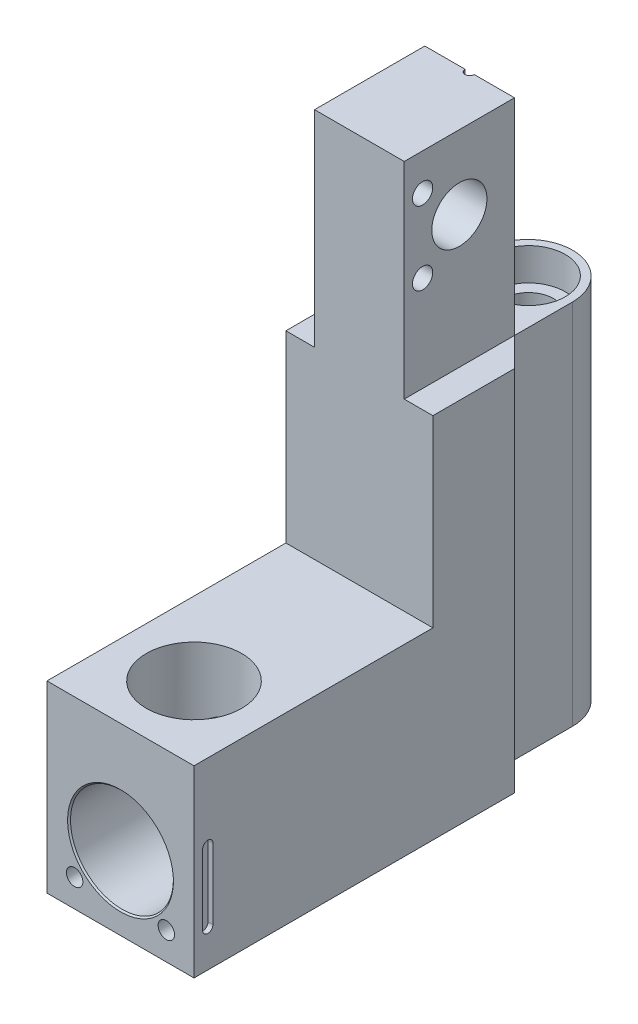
ISO-10303-21;
HEADER;
FILE_DESCRIPTION(('STEP AP214'),'2;1');
FILE_NAME('part.step','',(''),(''),'','','');
FILE_SCHEMA(('AUTOMOTIVE_DESIGN { 1 0 10303 214 1 1 1 1 }'));
ENDSEC;
DATA;
#1=APPLICATION_CONTEXT('core data for automotive mechanical design processes');
#2=APPLICATION_PROTOCOL_DEFINITION('international standard','automotive_design',2000,#1);
#3=PRODUCT_CONTEXT('',#1,'mechanical');
#4=PRODUCT('Part','Part','',(#3));
#5=PRODUCT_RELATED_PRODUCT_CATEGORY('part','',(#4));
#6=PRODUCT_DEFINITION_FORMATION('','',#4);
#7=PRODUCT_DEFINITION_CONTEXT('part definition',#1,'design');
#8=PRODUCT_DEFINITION('design','',#6,#7);
#9=PRODUCT_DEFINITION_SHAPE('','',#8);
#10=(LENGTH_UNIT() NAMED_UNIT(*) SI_UNIT(.MILLI.,.METRE.));
#11=(NAMED_UNIT(*) PLANE_ANGLE_UNIT() SI_UNIT($,.RADIAN.));
#12=(NAMED_UNIT(*) SI_UNIT($,.STERADIAN.) SOLID_ANGLE_UNIT());
#13=UNCERTAINTY_MEASURE_WITH_UNIT(LENGTH_MEASURE(1.E-05),#10,'distance_accuracy_value','');
#14=(GEOMETRIC_REPRESENTATION_CONTEXT(3) GLOBAL_UNCERTAINTY_ASSIGNED_CONTEXT((#13)) GLOBAL_UNIT_ASSIGNED_CONTEXT((#10,
#11,#12)) REPRESENTATION_CONTEXT('',''));
#15=CARTESIAN_POINT('',(0.,0.,0.));
#16=DIRECTION('',(0.,0.,1.));
#17=DIRECTION('',(1.,0.,0.));
#18=AXIS2_PLACEMENT_3D('',#15,#16,#17);
#19=CARTESIAN_POINT('',(7.74700000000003,63.5,0.));
#20=DIRECTION('',(0.,1.,0.));
#21=DIRECTION('',(0.,0.,1.));
#22=AXIS2_PLACEMENT_3D('',#19,#20,#21);
#23=PLANE('',#22);
#24=DIRECTION('',(0.70710678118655,0.,0.70710678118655));
#25=VECTOR('',#24,1.);
#26=CARTESIAN_POINT('',(7.74700000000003,63.5,0.));
#27=LINE('',#26,#25);
#28=CARTESIAN_POINT('',(7.74700000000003,63.5,0.));
#29=VERTEX_POINT('',#28);
#30=CARTESIAN_POINT('',(12.7000000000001,63.5,4.95300000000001));
#31=VERTEX_POINT('',#30);
#32=EDGE_CURVE('E300',#29,#31,#27,.T.);
#33=ORIENTED_EDGE('',*,*,#32,.F.);
#34=DIRECTION('',(0.,0.,-1.));
#35=VECTOR('',#34,1.);
#36=CARTESIAN_POINT('',(7.74700000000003,63.5,0.));
#37=LINE('',#36,#35);
#38=CARTESIAN_POINT('',(7.74700000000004,63.5,19.0500000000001));
#39=VERTEX_POINT('',#38);
#40=EDGE_CURVE('E327',#39,#29,#37,.T.);
#41=ORIENTED_EDGE('',*,*,#40,.F.);
#42=DIRECTION('',(-1.,0.,0.));
#43=VECTOR('',#42,1.);
#44=CARTESIAN_POINT('',(12.7000000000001,63.5,19.0500000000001));
#45=LINE('',#44,#43);
#46=CARTESIAN_POINT('',(12.7000000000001,63.5,19.0500000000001));
#47=VERTEX_POINT('',#46);
#48=EDGE_CURVE('E546',#47,#39,#45,.T.);
#49=ORIENTED_EDGE('',*,*,#48,.F.);
#50=DIRECTION('',(0.,0.,-1.));
#51=VECTOR('',#50,1.);
#52=CARTESIAN_POINT('',(12.7000000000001,63.5,0.));
#53=LINE('',#52,#51);
#54=EDGE_CURVE('E412',#47,#31,#53,.T.);
#55=ORIENTED_EDGE('',*,*,#54,.T.);
#56=EDGE_LOOP('',(#33,#41,#49,#55));
#57=FACE_BOUND('',#56,.T.);
#58=ADVANCED_FACE('F37',(#57),#23,.T.);
#59=DIRECTION('',(0.,0.,-1.));
#60=VECTOR('',#59,1.);
#61=CARTESIAN_POINT('',(7.74700000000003,63.5,0.));
#62=LINE('',#61,#60);
#63=CARTESIAN_POINT('',(7.74700000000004,63.5,-10.0330000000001));
#64=VERTEX_POINT('',#63);
#65=EDGE_CURVE('E418',#29,#64,#62,.T.);
#66=ORIENTED_EDGE('',*,*,#65,.T.);
#67=CARTESIAN_POINT('',(0.,63.5,-10.0330000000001));
#68=DIRECTION('',(0.,1.,0.));
#69=DIRECTION('',(0.,0.,1.));
#70=AXIS2_PLACEMENT_3D('',#67,#68,#69);
#71=CIRCLE('',#70,7.747);
#72=CARTESIAN_POINT('',(0.,63.5,-17.7800000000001));
#73=VERTEX_POINT('',#72);
#74=EDGE_CURVE('E349',#64,#73,#71,.T.);
#75=ORIENTED_EDGE('',*,*,#74,.T.);
#76=CARTESIAN_POINT('',(0.,63.5,-10.0330000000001));
#77=DIRECTION('',(0.,1.,0.));
#78=DIRECTION('',(0.,0.,1.));
#79=AXIS2_PLACEMENT_3D('',#76,#77,#78);
#80=CIRCLE('',#79,7.747);
#81=CARTESIAN_POINT('',(-7.74700000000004,63.5,-10.0330000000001));
#82=VERTEX_POINT('',#81);
#83=EDGE_CURVE('E347',#73,#82,#80,.T.);
#84=ORIENTED_EDGE('',*,*,#83,.T.);
#85=DIRECTION('',(0.,0.,1.));
#86=VECTOR('',#85,1.);
#87=CARTESIAN_POINT('',(-7.74700000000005,63.5,-17.7800000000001));
#88=LINE('',#87,#86);
#89=CARTESIAN_POINT('',(-7.74700000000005,63.5,0.));
#90=VERTEX_POINT('',#89);
#91=EDGE_CURVE('E413',#82,#90,#88,.T.);
#92=ORIENTED_EDGE('',*,*,#91,.T.);
#93=DIRECTION('',(-1.,0.,0.));
#94=VECTOR('',#93,1.);
#95=CARTESIAN_POINT('',(-0.793750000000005,63.5,0.));
#96=LINE('',#95,#94);
#97=CARTESIAN_POINT('',(-0.793750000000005,63.5,0.));
#98=VERTEX_POINT('',#97);
#99=EDGE_CURVE('E315',#98,#90,#96,.T.);
#100=ORIENTED_EDGE('',*,*,#99,.F.);
#101=CARTESIAN_POINT('',(0.,63.5,0.));
#102=DIRECTION('',(0.,-1.,0.));
#103=DIRECTION('',(0.,0.,1.));
#104=AXIS2_PLACEMENT_3D('',#101,#102,#103);
#105=CIRCLE('',#104,0.79375);
#106=CARTESIAN_POINT('',(0.793750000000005,63.5,0.));
#107=VERTEX_POINT('',#106);
#108=EDGE_CURVE('E312',#107,#98,#105,.T.);
#109=ORIENTED_EDGE('',*,*,#108,.F.);
#110=DIRECTION('',(-1.,0.,0.));
#111=VECTOR('',#110,1.);
#112=CARTESIAN_POINT('',(0.793750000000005,63.5,0.));
#113=LINE('',#112,#111);
#114=EDGE_CURVE('E309',#29,#107,#113,.T.);
#115=ORIENTED_EDGE('',*,*,#114,.F.);
#116=EDGE_LOOP('',(#66,#75,#84,#92,#100,#109,#115));
#117=FACE_BOUND('',#116,.T.);
#118=CARTESIAN_POINT('',(0.,63.5,-10.1600000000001));
#119=DIRECTION('',(0.,1.,0.));
#120=DIRECTION('',(0.,0.,1.));
#121=AXIS2_PLACEMENT_3D('',#118,#119,#120);
#122=CIRCLE('',#121,6.35);
#123=CARTESIAN_POINT('',(0.,63.5,-3.81000000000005));
#124=VERTEX_POINT('',#123);
#125=EDGE_CURVE('E470',#124,#124,#122,.T.);
#126=ORIENTED_EDGE('',*,*,#125,.F.);
#127=EDGE_LOOP('',(#126));
#128=FACE_BOUND('',#127,.T.);
#129=ADVANCED_FACE('F377',(#117,#128),#23,.T.);
#130=CARTESIAN_POINT('',(0.,12.7,-9.52500000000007));
#131=DIRECTION('',(0.,0.,1.));
#132=DIRECTION('',(1.,0.,0.));
#133=AXIS2_PLACEMENT_3D('',#130,#131,#132);
#134=CYLINDRICAL_SURFACE('',#133,3.81);
#135=CARTESIAN_POINT('',(0.,8.89000000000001,-5.842));
#136=CARTESIAN_POINT('',(0.177821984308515,8.89000339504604,-5.84200335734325));
#137=CARTESIAN_POINT('',(0.355665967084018,8.90253885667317,-5.85307585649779));
#138=CARTESIAN_POINT('',(0.705341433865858,8.95168991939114,-5.89634893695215));
#139=CARTESIAN_POINT('',(0.877169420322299,8.98831929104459,-5.92856160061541));
#140=CARTESIAN_POINT('',(1.20893916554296,9.08279595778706,-6.01118496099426));
#141=CARTESIAN_POINT('',(1.3689469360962,9.1405126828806,-6.06148364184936));
#142=CARTESIAN_POINT('',(1.67535459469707,9.27402897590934,-6.17688754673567));
#143=CARTESIAN_POINT('',(1.82174887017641,9.34983595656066,-6.24199883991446));
#144=CARTESIAN_POINT('',(2.15387566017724,9.54917911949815,-6.4112830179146));
#145=CARTESIAN_POINT('',(2.332679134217,9.67979878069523,-6.52078580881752));
#146=CARTESIAN_POINT('',(2.5785191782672,9.89301151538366,-6.6949536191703));
#147=CARTESIAN_POINT('',(2.65685503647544,9.96710702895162,-6.75477459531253));
#148=CARTESIAN_POINT('',(2.80614664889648,10.1206417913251,-6.87671969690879));
#149=CARTESIAN_POINT('',(2.87710489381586,10.2000792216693,-6.93884303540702));
#150=CARTESIAN_POINT('',(3.01320426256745,10.3658061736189,-7.06571885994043));
#151=CARTESIAN_POINT('',(3.07818101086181,10.4522087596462,-7.13049909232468));
#152=CARTESIAN_POINT('',(3.2005886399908,10.6302164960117,-7.26012086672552));
#153=CARTESIAN_POINT('',(3.25801722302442,10.7218232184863,-7.3249624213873));
#154=CARTESIAN_POINT('',(3.36518130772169,10.9102010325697,-7.45303999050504));
#155=CARTESIAN_POINT('',(3.41493117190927,11.0069620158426,-7.51627881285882));
#156=CARTESIAN_POINT('',(3.50665452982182,11.2061819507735,-7.63921275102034));
#157=CARTESIAN_POINT('',(3.54863369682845,11.3086366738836,-7.69891043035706));
#158=CARTESIAN_POINT('',(3.62513766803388,11.5220424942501,-7.81302324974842));
#159=CARTESIAN_POINT('',(3.65950192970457,11.6331199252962,-7.86731333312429));
#160=CARTESIAN_POINT('',(3.71869851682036,11.8625276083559,-7.9646298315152));
#161=CARTESIAN_POINT('',(3.74354705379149,11.9808451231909,-8.00767536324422));
#162=CARTESIAN_POINT('',(3.77910178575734,12.2048424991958,-8.07082953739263));
#163=CARTESIAN_POINT('',(3.79143624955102,12.309508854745,-8.0935085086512));
#164=CARTESIAN_POINT('',(3.80730208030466,12.521653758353,-8.12287458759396));
#165=CARTESIAN_POINT('',(3.8108500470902,12.6291266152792,-8.12959184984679));
#166=CARTESIAN_POINT('',(3.8088009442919,12.8438035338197,-8.12575382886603));
#167=CARTESIAN_POINT('',(3.8031914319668,12.9510070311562,-8.11517504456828));
#168=CARTESIAN_POINT('',(3.78337462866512,13.1620256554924,-8.07874796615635));
#169=CARTESIAN_POINT('',(3.76914945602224,13.2658332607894,-8.05286791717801));
#170=CARTESIAN_POINT('',(3.72306446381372,13.5250184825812,-7.97206678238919));
#171=CARTESIAN_POINT('',(3.68579263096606,13.676810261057,-7.90899882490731));
#172=CARTESIAN_POINT('',(3.59586143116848,13.9686106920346,-7.7679407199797));
#173=CARTESIAN_POINT('',(3.5431373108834,14.1085664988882,-7.68988826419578));
#174=CARTESIAN_POINT('',(3.433297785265,14.3564508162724,-7.53991601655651));
#175=CARTESIAN_POINT('',(3.37823132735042,14.4659228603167,-7.46901013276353));
#176=CARTESIAN_POINT('',(3.25849029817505,14.6781826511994,-7.32519380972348));
#177=CARTESIAN_POINT('',(3.19380979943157,14.7809662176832,-7.25228215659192));
#178=CARTESIAN_POINT('',(3.05494028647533,14.9799422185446,-7.10670967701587));
#179=CARTESIAN_POINT('',(2.98075843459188,15.0761395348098,-7.03404870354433));
#180=CARTESIAN_POINT('',(2.82280340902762,15.2617820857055,-6.89070572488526));
#181=CARTESIAN_POINT('',(2.73903452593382,15.3512303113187,-6.82002285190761));
#182=CARTESIAN_POINT('',(2.51038196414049,15.5726388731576,-6.64225703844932));
#183=CARTESIAN_POINT('',(2.35816529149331,15.6992785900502,-6.53775586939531));
#184=CARTESIAN_POINT('',(2.02956244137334,15.9306688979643,-6.3439418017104));
#185=CARTESIAN_POINT('',(1.85322129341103,16.0354593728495,-6.25460128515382));
#186=CARTESIAN_POINT('',(1.51536031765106,16.1996577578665,-6.1133655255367));
#187=CARTESIAN_POINT('',(1.35790176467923,16.2639487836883,-6.05755573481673));
#188=CARTESIAN_POINT('',(1.11289983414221,16.3448567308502,-5.98701133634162));
#189=CARTESIAN_POINT('',(1.02973898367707,16.3692426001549,-5.96568745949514));
#190=CARTESIAN_POINT('',(0.860940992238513,16.4124732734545,-5.92781711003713));
#191=CARTESIAN_POINT('',(0.775304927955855,16.4313204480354,-5.911268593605));
#192=CARTESIAN_POINT('',(0.601562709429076,16.4632533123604,-5.88319729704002));
#193=CARTESIAN_POINT('',(0.513444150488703,16.4763009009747,-5.87170775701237));
#194=CARTESIAN_POINT('',(0.336010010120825,16.4962038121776,-5.85417078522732));
#195=CARTESIAN_POINT('',(0.246694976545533,16.5030618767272,-5.8481209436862));
#196=CARTESIAN_POINT('',(0.0675964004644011,16.5104537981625,-5.84159998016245));
#197=CARTESIAN_POINT('',(-0.0221871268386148,16.5109878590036,-5.84112867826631));
#198=CARTESIAN_POINT('',(-0.20139565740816,16.5057312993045,-5.84576604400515));
#199=CARTESIAN_POINT('',(-0.290820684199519,16.4999411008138,-5.85087433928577));
#200=CARTESIAN_POINT('',(-0.540348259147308,16.4749305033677,-5.87291976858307));
#201=CARTESIAN_POINT('',(-0.69928145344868,16.4486445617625,-5.89607445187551));
#202=CARTESIAN_POINT('',(-1.00939714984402,16.3773110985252,-5.95864861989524));
#203=CARTESIAN_POINT('',(-1.16057785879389,16.3322592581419,-5.99807184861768));
#204=CARTESIAN_POINT('',(-1.4605303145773,16.2227574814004,-6.09329778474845));
#205=CARTESIAN_POINT('',(-1.60870892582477,16.1573744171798,-6.14988420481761));
#206=CARTESIAN_POINT('',(-1.8914937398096,16.0111543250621,-6.27523914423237));
#207=CARTESIAN_POINT('',(-2.02609654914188,15.9303134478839,-6.34401069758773));
#208=CARTESIAN_POINT('',(-2.34662161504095,15.7106834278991,-6.52847506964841));
#209=CARTESIAN_POINT('',(-2.52341586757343,15.5634507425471,-6.65013134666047));
#210=CARTESIAN_POINT('',(-2.76408206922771,15.3246572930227,-6.84102611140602));
#211=CARTESIAN_POINT('',(-2.84038430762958,15.2418275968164,-6.90624170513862));
#212=CARTESIAN_POINT('',(-2.98484449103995,15.07051496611,-7.03824220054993));
#213=CARTESIAN_POINT('',(-3.05300561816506,14.9820342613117,-7.10502647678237));
#214=CARTESIAN_POINT('',(-3.18272687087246,14.7974688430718,-7.24034876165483));
#215=CARTESIAN_POINT('',(-3.24409862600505,14.7012558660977,-7.30889171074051));
#216=CARTESIAN_POINT('',(-3.35842928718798,14.5028242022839,-7.44450060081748));
#217=CARTESIAN_POINT('',(-3.41138236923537,14.4006014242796,-7.51156549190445));
#218=CARTESIAN_POINT('',(-3.50838856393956,14.1901932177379,-7.64149475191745));
#219=CARTESIAN_POINT('',(-3.55248196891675,14.0820377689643,-7.70437722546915));
#220=CARTESIAN_POINT('',(-3.63146794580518,13.8586833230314,-7.82277814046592));
#221=CARTESIAN_POINT('',(-3.66637606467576,13.7434966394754,-7.87830894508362));
#222=CARTESIAN_POINT('',(-3.72221556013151,13.5201976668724,-7.97075625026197));
#223=CARTESIAN_POINT('',(-3.74435146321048,13.4130128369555,-8.00913445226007));
#224=CARTESIAN_POINT('',(-3.77956080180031,13.1932808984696,-8.07161560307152));
#225=CARTESIAN_POINT('',(-3.79266255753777,13.0807517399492,-8.09576312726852));
#226=CARTESIAN_POINT('',(-3.8087555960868,12.8510775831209,-8.12558598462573));
#227=CARTESIAN_POINT('',(-3.81163078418,12.7338947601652,-8.13104918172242));
#228=CARTESIAN_POINT('',(-3.80657033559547,12.5005402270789,-8.12157971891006));
#229=CARTESIAN_POINT('',(-3.79862298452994,12.3843697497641,-8.10662495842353));
#230=CARTESIAN_POINT('',(-3.77038429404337,12.1352788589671,-8.05517419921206));
#231=CARTESIAN_POINT('',(-3.74803500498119,12.003368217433,-8.01512609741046));
#232=CARTESIAN_POINT('',(-3.69147714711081,11.7479778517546,-7.91919782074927));
#233=CARTESIAN_POINT('',(-3.65722379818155,11.6245321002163,-7.86325801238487));
#234=CARTESIAN_POINT('',(-3.58263454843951,11.3986972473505,-7.74876987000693));
#235=CARTESIAN_POINT('',(-3.54334886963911,11.2954713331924,-7.69114895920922));
#236=CARTESIAN_POINT('',(-3.45706163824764,11.0947690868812,-7.5717027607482));
#237=CARTESIAN_POINT('',(-3.41005431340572,10.9972971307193,-7.50987434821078));
#238=CARTESIAN_POINT('',(-3.3085170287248,10.8075395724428,-7.38414231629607));
#239=CARTESIAN_POINT('',(-3.25397617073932,10.7152617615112,-7.3202357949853));
#240=CARTESIAN_POINT('',(-3.13749782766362,10.5358275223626,-7.19204898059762));
#241=CARTESIAN_POINT('',(-3.07556234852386,10.4486697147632,-7.12776879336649));
#242=CARTESIAN_POINT('',(-2.93960091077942,10.2734816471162,-6.99559107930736));
#243=CARTESIAN_POINT('',(-2.86503019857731,10.1858237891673,-6.92775835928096));
#244=CARTESIAN_POINT('',(-2.70722584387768,10.0166419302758,-6.79448000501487));
#245=CARTESIAN_POINT('',(-2.62399036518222,9.93511923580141,-6.72903488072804));
#246=CARTESIAN_POINT('',(-2.44899071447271,9.77899797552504,-6.60201962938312));
#247=CARTESIAN_POINT('',(-2.35724847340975,9.70438254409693,-6.54044018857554));
#248=CARTESIAN_POINT('',(-2.16510383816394,9.56269567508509,-6.42233033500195));
#249=CARTESIAN_POINT('',(-2.06470211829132,9.4956236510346,-6.36579952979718));
#250=CARTESIAN_POINT('',(-1.81335757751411,9.34484642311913,-6.23776686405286));
#251=CARTESIAN_POINT('',(-1.65828928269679,9.26525260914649,-6.16934858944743));
#252=CARTESIAN_POINT('',(-1.33322989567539,9.12652271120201,-6.04933613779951));
#253=CARTESIAN_POINT('',(-1.1632549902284,9.06736477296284,-5.99772399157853));
#254=CARTESIAN_POINT('',(-0.829383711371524,8.97776461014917,-5.91928771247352));
#255=CARTESIAN_POINT('',(-0.666566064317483,8.94505039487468,-5.89050775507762));
#256=CARTESIAN_POINT('',(-0.335837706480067,8.90116997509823,-5.8518653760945));
#257=CARTESIAN_POINT('',(-0.167928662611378,8.8899967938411,-5.84199682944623));
#258=CARTESIAN_POINT('',(0.,8.89000000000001,-5.842));
#259=B_SPLINE_CURVE_WITH_KNOTS('',3,(#135,#136,#137,#138,#139,#140,#141,#142,#143,#144,#145,
#146,#147,#148,#149,#150,#151,#152,#153,#154,#155,#156,#157,#158,#159,#160,#161,#162,#163,#164,
#165,#166,#167,#168,#169,#170,#171,#172,#173,#174,#175,#176,#177,#178,#179,#180,#181,#182,#183,
#184,#185,#186,#187,#188,#189,#190,#191,#192,#193,#194,#195,#196,#197,#198,#199,#200,#201,#202,
#203,#204,#205,#206,#207,#208,#209,#210,#211,#212,#213,#214,#215,#216,#217,#218,#219,#220,#221,
#222,#223,#224,#225,#226,#227,#228,#229,#230,#231,#232,#233,#234,#235,#236,#237,#238,#239,#240,
#241,#242,#243,#244,#245,#246,#247,#248,#249,#250,#251,#252,#253,#254,#255,#256,#257,#258),
.UNSPECIFIED.,.T.,.F.,(4,2,2,2,2,2,2,2,2,2,2,2,2,2,2,2,2,2,2,2,2,2,2,2,2,2,2,2,2,2,2,2,2,2,2,2,
2,2,2,2,2,2,2,2,2,2,2,2,2,2,2,2,2,2,2,2,2,2,2,2,2,4),(0.,0.532754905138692,1.06581456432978,
1.59562802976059,2.1256589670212,2.86243301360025,3.2321087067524,3.60165918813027,
3.97942458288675,4.35730471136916,4.73446924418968,5.11135731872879,5.49556235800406,
5.87910990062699,6.20118957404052,6.52266029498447,6.84456817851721,7.16714647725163,
7.66992376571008,8.17483884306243,8.59904817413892,9.023520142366,9.44767399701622,
9.87163876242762,10.5407205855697,11.2085701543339,11.7431872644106,12.0106456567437,
12.2779894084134,12.5470644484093,12.8160202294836,13.0849673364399,13.3538964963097,
13.8397351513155,14.3256856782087,14.8384481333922,15.3513384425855,16.1275280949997,
16.5176758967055,16.9076706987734,17.3066550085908,17.705914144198,18.103314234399,
18.5000372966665,18.8469520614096,19.1927743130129,19.5425101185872,19.8926247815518,
20.3092421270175,20.7274439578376,21.1006733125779,21.4741829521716,21.8482386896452,
22.2221931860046,22.6225348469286,23.022961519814,23.422383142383,23.8217736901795,
24.3812773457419,24.9401807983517,25.4434583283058,25.9465728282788),.UNSPECIFIED.);
#260=CARTESIAN_POINT('',(0.,8.89000000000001,-5.842));
#261=VERTEX_POINT('',#260);
#262=EDGE_CURVE('E430',#261,#261,#259,.T.);
#263=ORIENTED_EDGE('',*,*,#262,.F.);
#264=EDGE_LOOP('',(#263));
#265=FACE_BOUND('',#264,.T.);
#266=CARTESIAN_POINT('',(0.,12.7,22.2250000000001));
#267=DIRECTION('',(0.,0.,1.));
#268=DIRECTION('',(1.,0.,0.));
#269=AXIS2_PLACEMENT_3D('',#266,#267,#268);
#270=CIRCLE('',#269,3.81);
#271=CARTESIAN_POINT('',(3.81000000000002,12.7,22.2250000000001));
#272=VERTEX_POINT('',#271);
#273=EDGE_CURVE('E538',#272,#272,#270,.F.);
#274=ORIENTED_EDGE('',*,*,#273,.F.);
#275=EDGE_LOOP('',(#274));
#276=FACE_BOUND('',#275,.T.);
#277=ADVANCED_FACE('F384',(#265,#276),#134,.F.);
#278=CARTESIAN_POINT('',(-12.7000000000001,63.5,60.3250000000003));
#279=DIRECTION('',(0.,0.,-1.));
#280=DIRECTION('',(-1.,0.,0.));
#281=AXIS2_PLACEMENT_3D('',#278,#279,#280);
#282=PLANE('',#281);
#283=CARTESIAN_POINT('',(-7.92058589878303,4.77941410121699,60.3250000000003));
#284=DIRECTION('',(0.,0.,1.));
#285=DIRECTION('',(1.,0.,0.));
#286=AXIS2_PLACEMENT_3D('',#283,#284,#285);
#287=CIRCLE('',#286,1.4224);
#288=CARTESIAN_POINT('',(-6.49818589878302,4.77941410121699,60.3250000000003));
#289=VERTEX_POINT('',#288);
#290=EDGE_CURVE('E277',#289,#289,#287,.T.);
#291=ORIENTED_EDGE('',*,*,#290,.F.);
#292=EDGE_LOOP('',(#291));
#293=FACE_BOUND('',#292,.T.);
#294=CARTESIAN_POINT('',(7.92058589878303,4.77941410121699,60.3250000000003));
#295=DIRECTION('',(0.,0.,1.));
#296=DIRECTION('',(1.,0.,0.));
#297=AXIS2_PLACEMENT_3D('',#294,#295,#296);
#298=CIRCLE('',#297,1.4224);
#299=CARTESIAN_POINT('',(9.34298589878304,4.77941410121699,60.3250000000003));
#300=VERTEX_POINT('',#299);
#301=EDGE_CURVE('E283',#300,#300,#298,.T.);
#302=ORIENTED_EDGE('',*,*,#301,.F.);
#303=EDGE_LOOP('',(#302));
#304=FACE_BOUND('',#303,.T.);
#305=CARTESIAN_POINT('',(0.,12.7,60.3250000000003));
#306=DIRECTION('',(0.,0.,-1.));
#307=DIRECTION('',(-1.,0.,0.));
#308=AXIS2_PLACEMENT_3D('',#305,#306,#307);
#309=CIRCLE('',#308,9.14400000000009);
#310=CARTESIAN_POINT('',(-9.14400000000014,12.7,60.3250000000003));
#311=VERTEX_POINT('',#310);
#312=EDGE_CURVE('E11',#311,#311,#309,.T.);
#313=ORIENTED_EDGE('',*,*,#312,.T.);
#314=EDGE_LOOP('',(#313));
#315=FACE_BOUND('',#314,.T.);
#316=DIRECTION('',(1.,0.,0.));
#317=VECTOR('',#316,1.);
#318=CARTESIAN_POINT('',(12.7000000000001,31.75,60.3250000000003));
#319=LINE('',#318,#317);
#320=CARTESIAN_POINT('',(-12.7000000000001,31.75,60.3250000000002));
#321=VERTEX_POINT('',#320);
#322=CARTESIAN_POINT('',(12.7000000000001,31.75,60.3250000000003));
#323=VERTEX_POINT('',#322);
#324=EDGE_CURVE('E584',#321,#323,#319,.T.);
#325=ORIENTED_EDGE('',*,*,#324,.F.);
#326=DIRECTION('',(0.,-1.,0.));
#327=VECTOR('',#326,1.);
#328=CARTESIAN_POINT('',(-12.7000000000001,63.5,60.3250000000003));
#329=LINE('',#328,#327);
#330=CARTESIAN_POINT('',(-12.7000000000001,0.,60.3250000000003));
#331=VERTEX_POINT('',#330);
#332=EDGE_CURVE('E423',#321,#331,#329,.T.);
#333=ORIENTED_EDGE('',*,*,#332,.T.);
#334=DIRECTION('',(1.,0.,0.));
#335=VECTOR('',#334,1.);
#336=CARTESIAN_POINT('',(-12.7000000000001,0.,60.3250000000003));
#337=LINE('',#336,#335);
#338=CARTESIAN_POINT('',(12.7000000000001,0.,60.3250000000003));
#339=VERTEX_POINT('',#338);
#340=EDGE_CURVE('E489',#331,#339,#337,.T.);
#341=ORIENTED_EDGE('',*,*,#340,.T.);
#342=DIRECTION('',(0.,-1.,0.));
#343=VECTOR('',#342,1.);
#344=CARTESIAN_POINT('',(12.7000000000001,63.5,60.3250000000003));
#345=LINE('',#344,#343);
#346=EDGE_CURVE('E416',#323,#339,#345,.T.);
#347=ORIENTED_EDGE('',*,*,#346,.F.);
#348=EDGE_LOOP('',(#325,#333,#341,#347));
#349=FACE_BOUND('',#348,.T.);
#350=ADVANCED_FACE('F451',(#293,#304,#315,#349),#282,.F.);
#351=CARTESIAN_POINT('',(7.74700000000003,63.5,0.));
#352=DIRECTION('',(-1.,0.,0.));
#353=DIRECTION('',(0.,0.,1.));
#354=AXIS2_PLACEMENT_3D('',#351,#352,#353);
#355=PLANE('',#354);
#356=DIRECTION('',(0.,0.,-1.));
#357=VECTOR('',#356,1.);
#358=CARTESIAN_POINT('',(7.74700000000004,0.,0.));
#359=LINE('',#358,#357);
#360=CARTESIAN_POINT('',(7.74700000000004,0.,0.));
#361=VERTEX_POINT('',#360);
#362=CARTESIAN_POINT('',(7.74700000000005,0.,-10.0330000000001));
#363=VERTEX_POINT('',#362);
#364=EDGE_CURVE('E481',#361,#363,#359,.T.);
#365=ORIENTED_EDGE('',*,*,#364,.T.);
#366=DIRECTION('',(0.,-1.,0.));
#367=VECTOR('',#366,1.);
#368=CARTESIAN_POINT('',(7.74700000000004,63.5,-10.0330000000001));
#369=LINE('',#368,#367);
#370=EDGE_CURVE('E344',#363,#64,#369,.F.);
#371=ORIENTED_EDGE('',*,*,#370,.T.);
#372=ORIENTED_EDGE('',*,*,#65,.F.);
#373=DIRECTION('',(0.,-1.,0.));
#374=VECTOR('',#373,1.);
#375=CARTESIAN_POINT('',(7.74700000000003,63.5,0.));
#376=LINE('',#375,#374);
#377=EDGE_CURVE('E342',#29,#361,#376,.T.);
#378=ORIENTED_EDGE('',*,*,#377,.T.);
#379=EDGE_LOOP('',(#365,#371,#372,#378));
#380=FACE_BOUND('',#379,.T.);
#381=ADVANCED_FACE('F39',(#380),#355,.F.);
#382=CARTESIAN_POINT('',(-7.74700000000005,63.5,-17.7800000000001));
#383=DIRECTION('',(1.,0.,0.));
#384=DIRECTION('',(0.,0.,-1.));
#385=AXIS2_PLACEMENT_3D('',#382,#383,#384);
#386=PLANE('',#385);
#387=ORIENTED_EDGE('',*,*,#91,.F.);
#388=DIRECTION('',(0.,-1.,0.));
#389=VECTOR('',#388,1.);
#390=CARTESIAN_POINT('',(-7.74700000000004,63.5,-10.0330000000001));
#391=LINE('',#390,#389);
#392=CARTESIAN_POINT('',(-7.74700000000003,0.,-10.0330000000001));
#393=VERTEX_POINT('',#392);
#394=EDGE_CURVE('E351',#82,#393,#391,.T.);
#395=ORIENTED_EDGE('',*,*,#394,.T.);
#396=DIRECTION('',(0.,0.,1.));
#397=VECTOR('',#396,1.);
#398=CARTESIAN_POINT('',(-7.74700000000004,0.,-17.7800000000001));
#399=LINE('',#398,#397);
#400=CARTESIAN_POINT('',(-7.74700000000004,0.,0.));
#401=VERTEX_POINT('',#400);
#402=EDGE_CURVE('E484',#393,#401,#399,.T.);
#403=ORIENTED_EDGE('',*,*,#402,.T.);
#404=DIRECTION('',(0.,-1.,0.));
#405=VECTOR('',#404,1.);
#406=CARTESIAN_POINT('',(-7.74700000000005,63.5,0.));
#407=LINE('',#406,#405);
#408=EDGE_CURVE('E426',#90,#401,#407,.T.);
#409=ORIENTED_EDGE('',*,*,#408,.F.);
#410=EDGE_LOOP('',(#387,#395,#403,#409));
#411=FACE_BOUND('',#410,.T.);
#412=ADVANCED_FACE('F886',(#411),#386,.F.);
#413=CARTESIAN_POINT('',(-12.7000000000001,63.5,0.));
#414=DIRECTION('',(1.,0.,0.));
#415=DIRECTION('',(0.,0.,-1.));
#416=AXIS2_PLACEMENT_3D('',#413,#414,#415);
#417=PLANE('',#416);
#418=DIRECTION('',(0.,-1.,0.));
#419=VECTOR('',#418,1.);
#420=CARTESIAN_POINT('',(-12.7,18.542,57.0534800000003));
#421=LINE('',#420,#419);
#422=CARTESIAN_POINT('',(-12.7,18.542,57.0534800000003));
#423=VERTEX_POINT('',#422);
#424=CARTESIAN_POINT('',(-12.7,6.34999999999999,57.0534800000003));
#425=VERTEX_POINT('',#424);
#426=EDGE_CURVE('E215',#423,#425,#421,.T.);
#427=ORIENTED_EDGE('',*,*,#426,.F.);
#428=CARTESIAN_POINT('',(-12.7,18.542,57.9424800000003));
#429=DIRECTION('',(-1.,0.,0.));
#430=DIRECTION('',(0.,0.,1.));
#431=AXIS2_PLACEMENT_3D('',#428,#429,#430);
#432=CIRCLE('',#431,0.889000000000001);
#433=CARTESIAN_POINT('',(-12.7,18.542,58.8314800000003));
#434=VERTEX_POINT('',#433);
#435=EDGE_CURVE('E54',#434,#423,#432,.T.);
#436=ORIENTED_EDGE('',*,*,#435,.F.);
#437=DIRECTION('',(0.,1.,0.));
#438=VECTOR('',#437,1.);
#439=CARTESIAN_POINT('',(-12.7,18.542,58.8314800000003));
#440=LINE('',#439,#438);
#441=CARTESIAN_POINT('',(-12.7,6.34999999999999,58.8314800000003));
#442=VERTEX_POINT('',#441);
#443=EDGE_CURVE('E222',#442,#434,#440,.T.);
#444=ORIENTED_EDGE('',*,*,#443,.F.);
#445=CARTESIAN_POINT('',(-12.7,6.34999999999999,57.9424800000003));
#446=DIRECTION('',(-1.,0.,0.));
#447=DIRECTION('',(0.,0.,1.));
#448=AXIS2_PLACEMENT_3D('',#445,#446,#447);
#449=CIRCLE('',#448,0.889000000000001);
#450=EDGE_CURVE('E204',#425,#442,#449,.T.);
#451=ORIENTED_EDGE('',*,*,#450,.F.);
#452=EDGE_LOOP('',(#427,#436,#444,#451));
#453=FACE_BOUND('',#452,.T.);
#454=DIRECTION('',(0.,0.,1.));
#455=VECTOR('',#454,1.);
#456=CARTESIAN_POINT('',(-12.7000000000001,63.5,0.));
#457=LINE('',#456,#455);
#458=CARTESIAN_POINT('',(-12.7000000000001,63.5,4.953));
#459=VERTEX_POINT('',#458);
#460=CARTESIAN_POINT('',(-12.7000000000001,63.5,19.0500000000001));
#461=VERTEX_POINT('',#460);
#462=EDGE_CURVE('E403',#459,#461,#457,.T.);
#463=ORIENTED_EDGE('',*,*,#462,.F.);
#464=DIRECTION('',(0.,-1.,0.));
#465=VECTOR('',#464,1.);
#466=CARTESIAN_POINT('',(-12.7000000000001,99.060025,4.953));
#467=LINE('',#466,#465);
#468=CARTESIAN_POINT('',(-12.7000000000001,0.,4.953));
#469=VERTEX_POINT('',#468);
#470=EDGE_CURVE('E291',#459,#469,#467,.T.);
#471=ORIENTED_EDGE('',*,*,#470,.T.);
#472=DIRECTION('',(0.,0.,1.));
#473=VECTOR('',#472,1.);
#474=CARTESIAN_POINT('',(-12.7000000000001,0.,0.));
#475=LINE('',#474,#473);
#476=EDGE_CURVE('E487',#469,#331,#475,.T.);
#477=ORIENTED_EDGE('',*,*,#476,.T.);
#478=ORIENTED_EDGE('',*,*,#332,.F.);
#479=DIRECTION('',(0.,0.,1.));
#480=VECTOR('',#479,1.);
#481=CARTESIAN_POINT('',(-12.7000000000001,31.75,60.3250000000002));
#482=LINE('',#481,#480);
#483=CARTESIAN_POINT('',(-12.7000000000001,31.75,19.0500000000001));
#484=VERTEX_POINT('',#483);
#485=EDGE_CURVE('E591',#484,#321,#482,.T.);
#486=ORIENTED_EDGE('',*,*,#485,.F.);
#487=DIRECTION('',(0.,1.,0.));
#488=VECTOR('',#487,1.);
#489=CARTESIAN_POINT('',(-12.7000000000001,31.75,19.0500000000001));
#490=LINE('',#489,#488);
#491=EDGE_CURVE('E411',#484,#461,#490,.T.);
#492=ORIENTED_EDGE('',*,*,#491,.T.);
#493=EDGE_LOOP('',(#463,#471,#477,#478,#486,#492));
#494=FACE_BOUND('',#493,.T.);
#495=ADVANCED_FACE('F219',(#453,#494),#417,.F.);
#496=CARTESIAN_POINT('',(12.7000000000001,63.5,0.));
#497=DIRECTION('',(-1.,0.,0.));
#498=DIRECTION('',(0.,0.,1.));
#499=AXIS2_PLACEMENT_3D('',#496,#497,#498);
#500=PLANE('',#499);
#501=DIRECTION('',(0.,-1.,0.));
#502=VECTOR('',#501,1.);
#503=CARTESIAN_POINT('',(12.7000000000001,18.542,58.8327500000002));
#504=LINE('',#503,#502);
#505=CARTESIAN_POINT('',(12.7000000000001,18.542,58.8327500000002));
#506=VERTEX_POINT('',#505);
#507=CARTESIAN_POINT('',(12.7000000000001,6.34999999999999,58.8327500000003));
#508=VERTEX_POINT('',#507);
#509=EDGE_CURVE('E241',#506,#508,#504,.T.);
#510=ORIENTED_EDGE('',*,*,#509,.F.);
#511=CARTESIAN_POINT('',(12.7000000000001,18.542,57.9437500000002));
#512=DIRECTION('',(1.,0.,0.));
#513=DIRECTION('',(0.,0.,-1.));
#514=AXIS2_PLACEMENT_3D('',#511,#512,#513);
#515=CIRCLE('',#514,0.889000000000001);
#516=CARTESIAN_POINT('',(12.7000000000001,18.542,57.0547500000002));
#517=VERTEX_POINT('',#516);
#518=EDGE_CURVE('E62',#517,#506,#515,.T.);
#519=ORIENTED_EDGE('',*,*,#518,.F.);
#520=DIRECTION('',(0.,1.,0.));
#521=VECTOR('',#520,1.);
#522=CARTESIAN_POINT('',(12.7000000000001,18.542,57.0547500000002));
#523=LINE('',#522,#521);
#524=CARTESIAN_POINT('',(12.7000000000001,6.34999999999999,57.0547500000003));
#525=VERTEX_POINT('',#524);
#526=EDGE_CURVE('E247',#525,#517,#523,.T.);
#527=ORIENTED_EDGE('',*,*,#526,.F.);
#528=CARTESIAN_POINT('',(12.7000000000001,6.34999999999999,57.9437500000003));
#529=DIRECTION('',(1.,0.,0.));
#530=DIRECTION('',(0.,0.,-1.));
#531=AXIS2_PLACEMENT_3D('',#528,#529,#530);
#532=CIRCLE('',#531,0.889000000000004);
#533=EDGE_CURVE('E244',#508,#525,#532,.T.);
#534=ORIENTED_EDGE('',*,*,#533,.F.);
#535=EDGE_LOOP('',(#510,#519,#527,#534));
#536=FACE_BOUND('',#535,.T.);
#537=DIRECTION('',(0.,0.,-1.));
#538=VECTOR('',#537,1.);
#539=CARTESIAN_POINT('',(12.7000000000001,0.,0.));
#540=LINE('',#539,#538);
#541=CARTESIAN_POINT('',(12.7000000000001,0.,4.953));
#542=VERTEX_POINT('',#541);
#543=EDGE_CURVE('E492',#339,#542,#540,.T.);
#544=ORIENTED_EDGE('',*,*,#543,.T.);
#545=DIRECTION('',(0.,-1.,0.));
#546=VECTOR('',#545,1.);
#547=CARTESIAN_POINT('',(12.7000000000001,99.060025,4.953));
#548=LINE('',#547,#546);
#549=EDGE_CURVE('E298',#31,#542,#548,.T.);
#550=ORIENTED_EDGE('',*,*,#549,.F.);
#551=ORIENTED_EDGE('',*,*,#54,.F.);
#552=DIRECTION('',(0.,1.,0.));
#553=VECTOR('',#552,1.);
#554=CARTESIAN_POINT('',(12.7000000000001,31.75,19.0500000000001));
#555=LINE('',#554,#553);
#556=CARTESIAN_POINT('',(12.7000000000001,31.75,19.0500000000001));
#557=VERTEX_POINT('',#556);
#558=EDGE_CURVE('E588',#557,#47,#555,.T.);
#559=ORIENTED_EDGE('',*,*,#558,.F.);
#560=DIRECTION('',(0.,0.,-1.));
#561=VECTOR('',#560,1.);
#562=CARTESIAN_POINT('',(12.7000000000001,31.75,60.3250000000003));
#563=LINE('',#562,#561);
#564=EDGE_CURVE('E541',#323,#557,#563,.T.);
#565=ORIENTED_EDGE('',*,*,#564,.F.);
#566=ORIENTED_EDGE('',*,*,#346,.T.);
#567=EDGE_LOOP('',(#544,#550,#551,#559,#565,#566));
#568=FACE_BOUND('',#567,.T.);
#569=ADVANCED_FACE('F391',(#536,#568),#500,.F.);
#570=DIRECTION('',(0.70710678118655,0.,-0.70710678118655));
#571=VECTOR('',#570,1.);
#572=CARTESIAN_POINT('',(0.,63.5,-7.747));
#573=LINE('',#572,#571);
#574=EDGE_CURVE('E294',#459,#90,#573,.T.);
#575=ORIENTED_EDGE('',*,*,#574,.F.);
#576=ORIENTED_EDGE('',*,*,#462,.T.);
#577=CARTESIAN_POINT('',(-7.74700000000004,63.5,19.0500000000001));
#578=VERTEX_POINT('',#577);
#579=EDGE_CURVE('E537',#578,#461,#45,.T.);
#580=ORIENTED_EDGE('',*,*,#579,.F.);
#581=DIRECTION('',(0.,0.,1.));
#582=VECTOR('',#581,1.);
#583=CARTESIAN_POINT('',(-7.74700000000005,63.5,0.));
#584=LINE('',#583,#582);
#585=EDGE_CURVE('E318',#90,#578,#584,.T.);
#586=ORIENTED_EDGE('',*,*,#585,.F.);
#587=EDGE_LOOP('',(#575,#576,#580,#586));
#588=FACE_BOUND('',#587,.T.);
#589=ADVANCED_FACE('F380',(#588),#23,.T.);
#590=CARTESIAN_POINT('',(7.74700000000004,0.,0.));
#591=DIRECTION('',(0.,1.,0.));
#592=DIRECTION('',(0.,0.,1.));
#593=AXIS2_PLACEMENT_3D('',#590,#591,#592);
#594=PLANE('',#593);
#595=ORIENTED_EDGE('',*,*,#476,.F.);
#596=DIRECTION('',(-0.70710678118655,0.,0.70710678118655));
#597=VECTOR('',#596,1.);
#598=CARTESIAN_POINT('',(-12.7000000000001,0.,4.953));
#599=LINE('',#598,#597);
#600=EDGE_CURVE('E289',#401,#469,#599,.T.);
#601=ORIENTED_EDGE('',*,*,#600,.F.);
#602=ORIENTED_EDGE('',*,*,#402,.F.);
#603=CARTESIAN_POINT('',(0.,0.,-10.0330000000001));
#604=DIRECTION('',(0.,1.,0.));
#605=DIRECTION('',(0.,0.,1.));
#606=AXIS2_PLACEMENT_3D('',#603,#604,#605);
#607=CIRCLE('',#606,7.747);
#608=CARTESIAN_POINT('',(0.,0.,-17.7800000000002));
#609=VERTEX_POINT('',#608);
#610=EDGE_CURVE('E339',#393,#609,#607,.F.);
#611=ORIENTED_EDGE('',*,*,#610,.T.);
#612=CARTESIAN_POINT('',(0.,0.,-10.0330000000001));
#613=DIRECTION('',(0.,1.,0.));
#614=DIRECTION('',(0.,0.,1.));
#615=AXIS2_PLACEMENT_3D('',#612,#613,#614);
#616=CIRCLE('',#615,7.747);
#617=EDGE_CURVE('E341',#609,#363,#616,.F.);
#618=ORIENTED_EDGE('',*,*,#617,.T.);
#619=ORIENTED_EDGE('',*,*,#364,.F.);
#620=DIRECTION('',(-0.70710678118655,0.,-0.70710678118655));
#621=VECTOR('',#620,1.);
#622=CARTESIAN_POINT('',(12.7000000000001,0.,4.953));
#623=LINE('',#622,#621);
#624=EDGE_CURVE('E296',#542,#361,#623,.T.);
#625=ORIENTED_EDGE('',*,*,#624,.F.);
#626=ORIENTED_EDGE('',*,*,#543,.F.);
#627=ORIENTED_EDGE('',*,*,#340,.F.);
#628=EDGE_LOOP('',(#595,#601,#602,#611,#618,#619,#625,#626,#627));
#629=FACE_BOUND('',#628,.T.);
#630=ADVANCED_FACE('F390',(#629),#594,.F.);
#631=CARTESIAN_POINT('',(0.,57.912,-10.1600000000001));
#632=DIRECTION('',(0.,1.,0.));
#633=DIRECTION('',(0.,0.,1.));
#634=AXIS2_PLACEMENT_3D('',#631,#632,#633);
#635=CYLINDRICAL_SURFACE('',#634,6.35);
#636=CARTESIAN_POINT('',(0.,57.912,-10.1600000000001));
#637=DIRECTION('',(0.,1.,0.));
#638=DIRECTION('',(0.,0.,1.));
#639=AXIS2_PLACEMENT_3D('',#636,#637,#638);
#640=CIRCLE('',#639,6.35);
#641=CARTESIAN_POINT('',(0.,57.912,-3.81000000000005));
#642=VERTEX_POINT('',#641);
#643=EDGE_CURVE('E473',#642,#642,#640,.T.);
#644=ORIENTED_EDGE('',*,*,#643,.F.);
#645=EDGE_LOOP('',(#644));
#646=FACE_BOUND('',#645,.T.);
#647=ORIENTED_EDGE('',*,*,#125,.T.);
#648=EDGE_LOOP('',(#647));
#649=FACE_BOUND('',#648,.T.);
#650=ADVANCED_FACE('F397',(#646,#649),#635,.F.);
#651=CARTESIAN_POINT('',(0.,57.912,-10.1600000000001));
#652=DIRECTION('',(0.,1.,0.));
#653=DIRECTION('',(0.,0.,1.));
#654=AXIS2_PLACEMENT_3D('',#651,#652,#653);
#655=PLANE('',#654);
#656=CARTESIAN_POINT('',(0.,57.912,-10.1600000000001));
#657=DIRECTION('',(0.,1.,0.));
#658=DIRECTION('',(0.,0.,1.));
#659=AXIS2_PLACEMENT_3D('',#656,#657,#658);
#660=CIRCLE('',#659,4.318);
#661=CARTESIAN_POINT('',(0.,57.912,-5.84200000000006));
#662=VERTEX_POINT('',#661);
#663=EDGE_CURVE('E437',#662,#662,#660,.T.);
#664=ORIENTED_EDGE('',*,*,#663,.F.);
#665=EDGE_LOOP('',(#664));
#666=FACE_BOUND('',#665,.T.);
#667=ORIENTED_EDGE('',*,*,#643,.T.);
#668=EDGE_LOOP('',(#667));
#669=FACE_BOUND('',#668,.T.);
#670=ADVANCED_FACE('F464',(#666,#669),#655,.T.);
#671=CARTESIAN_POINT('',(0.,7.11200000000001,-10.1600000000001));
#672=DIRECTION('',(0.,1.,0.));
#673=DIRECTION('',(0.,0.,1.));
#674=AXIS2_PLACEMENT_3D('',#671,#672,#673);
#675=CYLINDRICAL_SURFACE('',#674,4.318);
#676=ORIENTED_EDGE('',*,*,#262,.T.);
#677=EDGE_LOOP('',(#676));
#678=FACE_BOUND('',#677,.T.);
#679=CARTESIAN_POINT('',(0.,7.11200000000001,-10.1600000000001));
#680=DIRECTION('',(0.,1.,0.));
#681=DIRECTION('',(0.,0.,1.));
#682=AXIS2_PLACEMENT_3D('',#679,#680,#681);
#683=CIRCLE('',#682,4.318);
#684=CARTESIAN_POINT('',(0.,7.11200000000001,-5.84200000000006));
#685=VERTEX_POINT('',#684);
#686=EDGE_CURVE('E468',#685,#685,#683,.T.);
#687=ORIENTED_EDGE('',*,*,#686,.F.);
#688=EDGE_LOOP('',(#687));
#689=FACE_BOUND('',#688,.T.);
#690=ORIENTED_EDGE('',*,*,#663,.T.);
#691=EDGE_LOOP('',(#690));
#692=FACE_BOUND('',#691,.T.);
#693=ADVANCED_FACE('F444',(#678,#689,#692),#675,.F.);
#694=CARTESIAN_POINT('',(0.,7.11200000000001,-10.1600000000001));
#695=DIRECTION('',(0.,1.,0.));
#696=DIRECTION('',(0.,0.,1.));
#697=AXIS2_PLACEMENT_3D('',#694,#695,#696);
#698=PLANE('',#697);
#699=ORIENTED_EDGE('',*,*,#686,.T.);
#700=EDGE_LOOP('',(#699));
#701=FACE_BOUND('',#700,.T.);
#702=ADVANCED_FACE('F455',(#701),#698,.T.);
#703=CARTESIAN_POINT('',(12.7000000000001,31.75,19.0500000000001));
#704=DIRECTION('',(0.,0.,-1.));
#705=DIRECTION('',(-1.,0.,0.));
#706=AXIS2_PLACEMENT_3D('',#703,#704,#705);
#707=PLANE('',#706);
#708=ORIENTED_EDGE('',*,*,#48,.T.);
#709=DIRECTION('',(0.,-1.,0.));
#710=VECTOR('',#709,1.);
#711=CARTESIAN_POINT('',(7.74700000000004,99.06,19.0500000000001));
#712=LINE('',#711,#710);
#713=CARTESIAN_POINT('',(7.74700000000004,99.06,19.0500000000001));
#714=VERTEX_POINT('',#713);
#715=EDGE_CURVE('E334',#714,#39,#712,.T.);
#716=ORIENTED_EDGE('',*,*,#715,.F.);
#717=DIRECTION('',(1.,0.,0.));
#718=VECTOR('',#717,1.);
#719=CARTESIAN_POINT('',(7.74700000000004,99.06,19.0500000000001));
#720=LINE('',#719,#718);
#721=CARTESIAN_POINT('',(-7.74700000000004,99.06,19.0500000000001));
#722=VERTEX_POINT('',#721);
#723=EDGE_CURVE('E519',#722,#714,#720,.T.);
#724=ORIENTED_EDGE('',*,*,#723,.F.);
#725=DIRECTION('',(0.,-1.,0.));
#726=VECTOR('',#725,1.);
#727=CARTESIAN_POINT('',(-7.74700000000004,99.06,19.0500000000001));
#728=LINE('',#727,#726);
#729=EDGE_CURVE('E330',#722,#578,#728,.T.);
#730=ORIENTED_EDGE('',*,*,#729,.T.);
#731=ORIENTED_EDGE('',*,*,#579,.T.);
#732=ORIENTED_EDGE('',*,*,#491,.F.);
#733=DIRECTION('',(-1.,0.,0.));
#734=VECTOR('',#733,1.);
#735=CARTESIAN_POINT('',(12.7000000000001,31.75,19.0500000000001));
#736=LINE('',#735,#734);
#737=EDGE_CURVE('E582',#557,#484,#736,.T.);
#738=ORIENTED_EDGE('',*,*,#737,.F.);
#739=ORIENTED_EDGE('',*,*,#558,.T.);
#740=EDGE_LOOP('',(#708,#716,#724,#730,#731,#732,#738,#739));
#741=FACE_BOUND('',#740,.T.);
#742=ADVANCED_FACE('F453',(#741),#707,.F.);
#743=CARTESIAN_POINT('',(12.7000000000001,31.75,60.3250000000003));
#744=DIRECTION('',(0.,1.,0.));
#745=DIRECTION('',(0.,0.,1.));
#746=AXIS2_PLACEMENT_3D('',#743,#744,#745);
#747=PLANE('',#746);
#748=CARTESIAN_POINT('',(0.,31.75,47.6250000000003));
#749=DIRECTION('',(0.,1.,0.));
#750=DIRECTION('',(0.,0.,1.));
#751=AXIS2_PLACEMENT_3D('',#748,#749,#750);
#752=CIRCLE('',#751,8.2296);
#753=CARTESIAN_POINT('',(0.,31.75,55.8546000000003));
#754=VERTEX_POINT('',#753);
#755=EDGE_CURVE('E534',#754,#754,#752,.T.);
#756=ORIENTED_EDGE('',*,*,#755,.F.);
#757=EDGE_LOOP('',(#756));
#758=FACE_BOUND('',#757,.T.);
#759=ORIENTED_EDGE('',*,*,#564,.T.);
#760=ORIENTED_EDGE('',*,*,#737,.T.);
#761=ORIENTED_EDGE('',*,*,#485,.T.);
#762=ORIENTED_EDGE('',*,*,#324,.T.);
#763=EDGE_LOOP('',(#759,#760,#761,#762));
#764=FACE_BOUND('',#763,.T.);
#765=ADVANCED_FACE('F462',(#758,#764),#747,.T.);
#766=CARTESIAN_POINT('',(0.,13.97,47.6250000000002));
#767=DIRECTION('',(0.,1.,0.));
#768=DIRECTION('',(0.,0.,1.));
#769=AXIS2_PLACEMENT_3D('',#766,#767,#768);
#770=CYLINDRICAL_SURFACE('',#769,8.2296);
#771=CARTESIAN_POINT('',(0.,21.59,55.8546000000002));
#772=CARTESIAN_POINT('',(-0.188946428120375,21.590007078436,55.8546071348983));
#773=CARTESIAN_POINT('',(-0.377833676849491,21.5839686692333,55.8480856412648));
#774=CARTESIAN_POINT('',(-0.754019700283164,21.5599685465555,55.8221510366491));
#775=CARTESIAN_POINT('',(-0.941318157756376,21.5420045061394,55.8027354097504));
#776=CARTESIAN_POINT('',(-1.31284239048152,21.4945246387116,55.7513752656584));
#777=CARTESIAN_POINT('',(-1.49706552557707,21.4649993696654,55.719420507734));
#778=CARTESIAN_POINT('',(-1.86090631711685,21.3950242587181,55.6435956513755));
#779=CARTESIAN_POINT('',(-2.04052408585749,21.3545746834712,55.5997258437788));
#780=CARTESIAN_POINT('',(-2.39280215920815,21.263846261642,55.5011695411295));
#781=CARTESIAN_POINT('',(-2.5655014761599,21.2136361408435,55.4465586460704));
#782=CARTESIAN_POINT('',(-2.90440339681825,21.1040628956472,55.3271459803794));
#783=CARTESIAN_POINT('',(-3.07060357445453,21.0446963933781,55.2623404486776));
#784=CARTESIAN_POINT('',(-3.3957805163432,20.9177393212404,55.1234165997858));
#785=CARTESIAN_POINT('',(-3.55475771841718,20.8501492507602,55.0492988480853));
#786=CARTESIAN_POINT('',(-3.86508047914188,20.7076476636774,54.8925786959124));
#787=CARTESIAN_POINT('',(-4.01642428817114,20.6327344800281,54.8099743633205));
#788=CARTESIAN_POINT('',(-4.37068951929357,20.444932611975,54.6021701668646));
#789=CARTESIAN_POINT('',(-4.56977721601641,20.3289190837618,54.4732335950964));
#790=CARTESIAN_POINT('',(-4.9519647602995,20.0865672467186,54.2021786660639));
#791=CARTESIAN_POINT('',(-5.13506337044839,19.960228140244,54.0600592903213));
#792=CARTESIAN_POINT('',(-5.48568961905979,19.6990848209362,53.7639166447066));
#793=CARTESIAN_POINT('',(-5.65318340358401,19.5642632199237,53.6098687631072));
#794=CARTESIAN_POINT('',(-5.97235935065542,19.2884374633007,53.2913981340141));
#795=CARTESIAN_POINT('',(-6.12404344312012,19.1474340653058,53.126976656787));
#796=CARTESIAN_POINT('',(-6.41551179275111,18.8576434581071,52.7843952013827));
#797=CARTESIAN_POINT('',(-6.55490791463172,18.7087499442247,52.6059957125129));
#798=CARTESIAN_POINT('',(-6.81781997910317,18.408696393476,52.2395977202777));
#799=CARTESIAN_POINT('',(-6.94133258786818,18.2575358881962,52.0515972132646));
#800=CARTESIAN_POINT('',(-7.1724874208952,17.9558116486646,51.6663039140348));
#801=CARTESIAN_POINT('',(-7.28015827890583,17.8052473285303,51.4690287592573));
#802=CARTESIAN_POINT('',(-7.4799166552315,17.5078040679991,51.064202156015));
#803=CARTESIAN_POINT('',(-7.57201172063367,17.3609233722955,50.8566557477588));
#804=CARTESIAN_POINT('',(-7.73783763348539,17.079925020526,50.4360111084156));
#805=CARTESIAN_POINT('',(-7.81203826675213,16.9455561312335,50.2232686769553));
#806=CARTESIAN_POINT('',(-7.94469181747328,16.691789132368,49.7839071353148));
#807=CARTESIAN_POINT('',(-8.00313957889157,16.5723959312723,49.5572835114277));
#808=CARTESIAN_POINT('',(-8.09435081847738,16.3774069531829,49.1245539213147));
#809=CARTESIAN_POINT('',(-8.12970877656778,16.2978755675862,48.9208316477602));
#810=CARTESIAN_POINT('',(-8.18541482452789,16.1693120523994,48.502186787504));
#811=CARTESIAN_POINT('',(-8.20581731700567,16.1201694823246,48.2873078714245));
#812=CARTESIAN_POINT('',(-8.22743925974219,16.0677967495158,47.887175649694));
#813=CARTESIAN_POINT('',(-8.23127894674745,16.0583039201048,47.7029191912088));
#814=CARTESIAN_POINT('',(-8.2265616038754,16.0698373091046,47.3355410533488));
#815=CARTESIAN_POINT('',(-8.21800136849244,16.0908714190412,47.1524196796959));
#816=CARTESIAN_POINT('',(-8.18496478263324,16.16997296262,46.7370367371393));
#817=CARTESIAN_POINT('',(-8.15640612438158,16.2374336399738,46.5069650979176));
#818=CARTESIAN_POINT('',(-8.082712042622,16.4026934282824,46.0604410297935));
#819=CARTESIAN_POINT('',(-8.03750004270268,16.5006323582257,45.8440570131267));
#820=CARTESIAN_POINT('',(-7.93290177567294,16.7143958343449,45.4245449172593));
#821=CARTESIAN_POINT('',(-7.87353015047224,16.8302018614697,45.2214034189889));
#822=CARTESIAN_POINT('',(-7.74171159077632,17.0723051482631,44.8257617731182));
#823=CARTESIAN_POINT('',(-7.66925144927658,17.198612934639,44.6332726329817));
#824=CARTESIAN_POINT('',(-7.51170391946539,17.4570336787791,44.2571787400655));
#825=CARTESIAN_POINT('',(-7.42659811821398,17.5891549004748,44.0735874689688));
#826=CARTESIAN_POINT('',(-7.24402405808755,17.8558062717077,43.7146359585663));
#827=CARTESIAN_POINT('',(-7.14656045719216,17.990335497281,43.5392726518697));
#828=CARTESIAN_POINT('',(-6.92418909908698,18.279025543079,43.1714000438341));
#829=CARTESIAN_POINT('',(-6.79735073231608,18.4332139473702,42.9800750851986));
#830=CARTESIAN_POINT('',(-6.52706727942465,18.7391386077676,42.607360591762));
#831=CARTESIAN_POINT('',(-6.38361859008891,18.8908743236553,42.4259732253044));
#832=CARTESIAN_POINT('',(-6.0799677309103,19.1893234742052,42.0739439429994));
#833=CARTESIAN_POINT('',(-5.91979071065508,19.3360440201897,41.9032864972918));
#834=CARTESIAN_POINT('',(-5.58229220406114,19.6223662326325,41.5735510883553));
#835=CARTESIAN_POINT('',(-5.40497524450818,19.761969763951,41.4144700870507));
#836=CARTESIAN_POINT('',(-4.91965081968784,20.1138631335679,41.0164610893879));
#837=CARTESIAN_POINT('',(-4.59760436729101,20.3188849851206,40.7876227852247));
#838=CARTESIAN_POINT('',(-4.08162483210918,20.6000569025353,40.4760794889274));
#839=CARTESIAN_POINT('',(-3.90415686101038,20.6893833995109,40.3775217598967));
#840=CARTESIAN_POINT('',(-3.53852208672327,20.8579052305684,40.1921582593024));
#841=CARTESIAN_POINT('',(-3.35035717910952,20.9371023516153,40.1053504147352));
#842=CARTESIAN_POINT('',(-2.99675489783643,21.0714429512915,39.9584494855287));
#843=CARTESIAN_POINT('',(-2.8328443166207,21.1283899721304,39.896320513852));
#844=CARTESIAN_POINT('',(-2.49884368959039,21.2333759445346,39.7819625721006));
#845=CARTESIAN_POINT('',(-2.32875493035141,21.2814167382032,39.7297315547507));
#846=CARTESIAN_POINT('',(-1.98331300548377,21.3677707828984,39.6359574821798));
#847=CARTESIAN_POINT('',(-1.80796217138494,21.4060882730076,39.5944097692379));
#848=CARTESIAN_POINT('',(-1.4530056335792,21.4723123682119,39.5226626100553));
#849=CARTESIAN_POINT('',(-1.27339989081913,21.5002188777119,39.4924632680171));
#850=CARTESIAN_POINT('',(-0.910349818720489,21.5451668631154,39.443846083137));
#851=CARTESIAN_POINT('',(-0.726891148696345,21.5621552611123,39.4254857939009));
#852=CARTESIAN_POINT('',(-0.35844952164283,21.5846877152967,39.4011375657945));
#853=CARTESIAN_POINT('',(-0.173466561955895,21.5902317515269,39.3951496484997));
#854=CARTESIAN_POINT('',(0.196450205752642,21.5897533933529,39.3956663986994));
#855=CARTESIAN_POINT('',(0.381384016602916,21.5837319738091,39.4021700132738));
#856=CARTESIAN_POINT('',(0.749661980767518,21.5602567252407,39.4275376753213));
#857=CARTESIAN_POINT('',(0.933006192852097,21.5428033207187,39.4464012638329));
#858=CARTESIAN_POINT('',(1.28267707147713,21.4986065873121,39.4942085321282));
#859=CARTESIAN_POINT('',(1.44922987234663,21.4726790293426,39.5222674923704));
#860=CARTESIAN_POINT('',(1.77877613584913,21.4118391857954,39.5881773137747));
#861=CARTESIAN_POINT('',(1.94176823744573,21.3769235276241,39.6260318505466));
#862=CARTESIAN_POINT('',(2.26323879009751,21.2986753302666,39.7109803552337));
#863=CARTESIAN_POINT('',(2.42171750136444,21.2553432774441,39.7580737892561));
#864=CARTESIAN_POINT('',(2.73348174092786,21.1608936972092,39.8608934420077));
#865=CARTESIAN_POINT('',(2.8867662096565,21.1097745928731,39.9166214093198));
#866=CARTESIAN_POINT('',(3.23655638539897,20.9826196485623,40.055520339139));
#867=CARTESIAN_POINT('',(3.43088894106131,20.903889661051,40.1417194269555));
#868=CARTESIAN_POINT('',(3.80854490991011,20.7355375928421,40.3266750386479));
#869=CARTESIAN_POINT('',(3.9918653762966,20.6459126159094,40.4254349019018));
#870=CARTESIAN_POINT('',(4.34721153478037,20.4572143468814,40.6342493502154));
#871=CARTESIAN_POINT('',(4.51922142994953,20.3581282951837,40.7443192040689));
#872=CARTESIAN_POINT('',(4.85148338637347,20.1520765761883,40.9744149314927));
#873=CARTESIAN_POINT('',(5.01173221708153,20.0451087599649,41.0944435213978));
#874=CARTESIAN_POINT('',(5.37203381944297,19.7878332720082,41.3850018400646));
#875=CARTESIAN_POINT('',(5.56748795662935,19.6349898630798,41.5590017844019));
#876=CARTESIAN_POINT('',(5.93768798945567,19.3207958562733,41.9208584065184));
#877=CARTESIAN_POINT('',(6.11242521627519,19.1594417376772,42.1087208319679));
#878=CARTESIAN_POINT('',(6.44181635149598,18.8310077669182,42.497206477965));
#879=CARTESIAN_POINT('',(6.59644295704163,18.6639205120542,42.6978465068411));
#880=CARTESIAN_POINT('',(6.88576650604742,18.3273877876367,43.1110045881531));
#881=CARTESIAN_POINT('',(7.02047034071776,18.1579431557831,43.3235184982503));
#882=CARTESIAN_POINT('',(7.23509123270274,17.8680084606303,43.6991317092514));
#883=CARTESIAN_POINT('',(7.31975037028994,17.7471784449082,43.8592806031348));
#884=CARTESIAN_POINT('',(7.47900589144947,17.5080340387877,44.1864097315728));
#885=CARTESIAN_POINT('',(7.5536002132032,17.3897201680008,44.3533913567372));
#886=CARTESIAN_POINT('',(7.69239387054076,17.158397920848,44.694598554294));
#887=CARTESIAN_POINT('',(7.75661627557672,17.0453781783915,44.8688069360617));
#888=CARTESIAN_POINT('',(7.87440740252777,16.8280803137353,45.2259662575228));
#889=CARTESIAN_POINT('',(7.92798417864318,16.7237956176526,45.4089104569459));
#890=CARTESIAN_POINT('',(8.02396589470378,16.5288274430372,45.786394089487));
#891=CARTESIAN_POINT('',(8.06630107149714,16.4382303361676,45.9809971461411));
#892=CARTESIAN_POINT('',(8.13767357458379,16.2802124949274,46.3817080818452));
#893=CARTESIAN_POINT('',(8.16673975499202,16.2127415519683,46.587789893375));
#894=CARTESIAN_POINT('',(8.20589170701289,16.1201788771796,46.9759691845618));
#895=CARTESIAN_POINT('',(8.21828396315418,16.0900042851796,47.1565683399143));
#896=CARTESIAN_POINT('',(8.23094547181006,16.059162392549,47.5206176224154));
#897=CARTESIAN_POINT('',(8.23123068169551,16.0584562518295,47.7040636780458));
#898=CARTESIAN_POINT('',(8.21969635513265,16.0865715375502,48.0677256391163));
#899=CARTESIAN_POINT('',(8.20790399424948,16.1153266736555,48.2479478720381));
#900=CARTESIAN_POINT('',(8.17336794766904,16.1971496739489,48.6018004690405));
#901=CARTESIAN_POINT('',(8.15060158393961,16.2502678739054,48.775416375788));
#902=CARTESIAN_POINT('',(8.09751265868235,16.3696496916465,49.102167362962));
#903=CARTESIAN_POINT('',(8.06785423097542,16.4346875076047,49.2558761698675));
#904=CARTESIAN_POINT('',(8.00116219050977,16.5755103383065,49.5567037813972));
#905=CARTESIAN_POINT('',(7.96412173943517,16.6513052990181,49.7038163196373));
#906=CARTESIAN_POINT('',(7.88311323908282,16.8105520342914,49.9925764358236));
#907=CARTESIAN_POINT('',(7.83911910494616,16.8940321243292,50.1342008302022));
#908=CARTESIAN_POINT('',(7.74464938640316,17.0660239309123,50.4121586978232));
#909=CARTESIAN_POINT('',(7.69417149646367,17.1545374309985,50.5484902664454));
#910=CARTESIAN_POINT('',(7.53798934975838,17.4170870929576,50.9388201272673));
#911=CARTESIAN_POINT('',(7.42393724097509,17.5954294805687,51.1866169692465));
#912=CARTESIAN_POINT('',(7.1732686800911,17.9559241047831,51.6677793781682));
#913=CARTESIAN_POINT('',(7.03663487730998,18.1380791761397,51.9011336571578));
#914=CARTESIAN_POINT('',(6.74074627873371,18.5007894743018,52.3538112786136));
#915=CARTESIAN_POINT('',(6.58151918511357,18.6813463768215,52.5731513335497));
#916=CARTESIAN_POINT('',(6.2398594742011,19.0369590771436,52.9975809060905));
#917=CARTESIAN_POINT('',(6.05743989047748,19.2120178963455,53.2026783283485));
#918=CARTESIAN_POINT('',(5.7174479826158,19.5103174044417,53.5478488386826));
#919=CARTESIAN_POINT('',(5.56509774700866,19.6355538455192,53.6913409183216));
#920=CARTESIAN_POINT('',(5.2468651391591,19.8793269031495,53.9686036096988));
#921=CARTESIAN_POINT('',(5.08098271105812,19.9978634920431,54.102374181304));
#922=CARTESIAN_POINT('',(4.5632697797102,20.3406475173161,54.4870196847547));
#923=CARTESIAN_POINT('',(4.19069540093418,20.5526808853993,54.7219289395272));
#924=CARTESIAN_POINT('',(3.47584383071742,20.889792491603,55.0930351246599));
#925=CARTESIAN_POINT('',(3.14321535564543,21.0237852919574,55.2395993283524));
#926=CARTESIAN_POINT('',(2.62353049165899,21.1960313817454,55.4273957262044));
#927=CARTESIAN_POINT('',(2.44688900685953,21.2486472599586,55.4846432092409));
#928=CARTESIAN_POINT('',(2.08756765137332,21.3434178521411,55.5876185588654));
#929=CARTESIAN_POINT('',(1.90488906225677,21.3855747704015,55.6333488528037));
#930=CARTESIAN_POINT('',(1.44080941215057,21.4770635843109,55.7325026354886));
#931=CARTESIAN_POINT('',(1.15623681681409,21.519228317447,55.7781059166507));
#932=CARTESIAN_POINT('',(0.581062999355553,21.5756915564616,55.8391496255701));
#933=CARTESIAN_POINT('',(0.290461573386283,21.5899891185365,55.8545890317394));
#934=CARTESIAN_POINT('',(0.,21.59,55.8546000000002));
#935=B_SPLINE_CURVE_WITH_KNOTS('',3,(#771,#772,#773,#774,#775,#776,#777,#778,#779,#780,#781,
#782,#783,#784,#785,#786,#787,#788,#789,#790,#791,#792,#793,#794,#795,#796,#797,#798,#799,#800,
#801,#802,#803,#804,#805,#806,#807,#808,#809,#810,#811,#812,#813,#814,#815,#816,#817,#818,#819,
#820,#821,#822,#823,#824,#825,#826,#827,#828,#829,#830,#831,#832,#833,#834,#835,#836,#837,#838,
#839,#840,#841,#842,#843,#844,#845,#846,#847,#848,#849,#850,#851,#852,#853,#854,#855,#856,#857,
#858,#859,#860,#861,#862,#863,#864,#865,#866,#867,#868,#869,#870,#871,#872,#873,#874,#875,#876,
#877,#878,#879,#880,#881,#882,#883,#884,#885,#886,#887,#888,#889,#890,#891,#892,#893,#894,#895,
#896,#897,#898,#899,#900,#901,#902,#903,#904,#905,#906,#907,#908,#909,#910,#911,#912,#913,#914,
#915,#916,#917,#918,#919,#920,#921,#922,#923,#924,#925,#926,#927,#928,#929,#930,#931,#932,#933,
#934),.UNSPECIFIED.,.T.,.F.,(4,2,2,2,2,2,2,2,2,2,2,2,2,2,2,2,2,2,2,2,2,2,2,2,2,2,2,2,2,2,2,2,2,
2,2,2,2,2,2,2,2,2,2,2,2,2,2,2,2,2,2,2,2,2,2,2,2,2,2,2,2,2,2,2,2,2,2,2,2,2,2,2,2,2,2,2,2,2,2,2,2,
4),(0.,0.566530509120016,1.13317159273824,1.70027641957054,2.26736740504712,2.83060127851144,
3.39404343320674,3.9574513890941,4.52098790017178,5.31194865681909,6.10297057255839,
6.895670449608,7.68827344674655,8.50052188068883,9.31294052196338,10.1238721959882,
10.9344098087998,11.7205210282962,12.5068892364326,13.1695043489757,13.8296969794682,
14.3804006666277,14.9312467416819,15.6513500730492,16.3748068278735,17.0975187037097,
17.8209639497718,18.5454730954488,19.2697099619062,20.0986057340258,20.9276816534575,
21.7555285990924,22.5831574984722,23.9127446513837,24.577468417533,25.2420747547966,
25.7944672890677,26.34674544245,26.8987824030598,27.4508244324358,28.0055302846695,
28.5602371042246,29.1148971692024,29.6695366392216,30.1816094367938,30.6938746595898,
31.2061102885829,31.7184497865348,32.3975660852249,33.0768633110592,33.7570899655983,
34.4375027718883,35.345339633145,36.2535550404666,37.1629908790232,38.0721114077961,
38.7250488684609,39.3781198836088,40.0297176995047,40.680820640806,41.3358744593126,
41.9894969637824,42.5376098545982,43.0850002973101,43.6311617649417,44.1784567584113,
44.6862421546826,45.1945001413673,45.7047120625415,46.2151059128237,47.1914481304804,
48.1685440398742,49.1444520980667,50.1198141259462,50.8508559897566,51.5819008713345,
53.0405721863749,54.1978193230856,54.7761718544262,55.3544023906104,56.2252829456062,
57.0961929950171),.UNSPECIFIED.);
#936=CARTESIAN_POINT('',(0.,21.59,55.8546000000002));
#937=VERTEX_POINT('',#936);
#938=EDGE_CURVE('E438',#937,#937,#935,.T.);
#939=ORIENTED_EDGE('',*,*,#938,.T.);
#940=EDGE_LOOP('',(#939));
#941=FACE_BOUND('',#940,.T.);
#942=ORIENTED_EDGE('',*,*,#755,.T.);
#943=EDGE_LOOP('',(#942));
#944=FACE_BOUND('',#943,.T.);
#945=ADVANCED_FACE('F553',(#941,#944),#770,.F.);
#946=CARTESIAN_POINT('',(0.,12.7,22.2250000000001));
#947=DIRECTION('',(0.,0.,1.));
#948=DIRECTION('',(1.,0.,0.));
#949=AXIS2_PLACEMENT_3D('',#946,#947,#948);
#950=PLANE('',#949);
#951=CARTESIAN_POINT('',(0.,12.7,22.2250000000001));
#952=DIRECTION('',(0.,0.,1.));
#953=DIRECTION('',(1.,0.,0.));
#954=AXIS2_PLACEMENT_3D('',#951,#952,#953);
#955=CIRCLE('',#954,8.89);
#956=CARTESIAN_POINT('',(8.89000000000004,12.7,22.2250000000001));
#957=VERTEX_POINT('',#956);
#958=EDGE_CURVE('E531',#957,#957,#955,.T.);
#959=ORIENTED_EDGE('',*,*,#958,.T.);
#960=EDGE_LOOP('',(#959));
#961=FACE_BOUND('',#960,.T.);
#962=ORIENTED_EDGE('',*,*,#273,.T.);
#963=EDGE_LOOP('',(#962));
#964=FACE_BOUND('',#963,.T.);
#965=ADVANCED_FACE('F558',(#961,#964),#950,.T.);
#966=CARTESIAN_POINT('',(0.,12.7,22.2250000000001));
#967=DIRECTION('',(0.,0.,1.));
#968=DIRECTION('',(1.,0.,0.));
#969=AXIS2_PLACEMENT_3D('',#966,#967,#968);
#970=CYLINDRICAL_SURFACE('',#969,8.89);
#971=CARTESIAN_POINT('',(0.,12.7,60.0710000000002));
#972=DIRECTION('',(0.,0.,-1.));
#973=DIRECTION('',(-1.,0.,0.));
#974=AXIS2_PLACEMENT_3D('',#971,#972,#973);
#975=CIRCLE('',#974,8.89);
#976=CARTESIAN_POINT('',(-8.89000000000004,12.7,60.0710000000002));
#977=VERTEX_POINT('',#976);
#978=EDGE_CURVE('E46',#977,#977,#975,.F.);
#979=ORIENTED_EDGE('',*,*,#978,.T.);
#980=EDGE_LOOP('',(#979));
#981=FACE_BOUND('',#980,.T.);
#982=ORIENTED_EDGE('',*,*,#958,.F.);
#983=EDGE_LOOP('',(#982));
#984=FACE_BOUND('',#983,.T.);
#985=ORIENTED_EDGE('',*,*,#938,.F.);
#986=EDGE_LOOP('',(#985));
#987=FACE_BOUND('',#986,.T.);
#988=ADVANCED_FACE('F556',(#981,#984,#987),#970,.F.);
#989=CARTESIAN_POINT('',(0.793750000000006,99.06,0.));
#990=DIRECTION('',(0.,0.,1.));
#991=DIRECTION('',(1.,0.,0.));
#992=AXIS2_PLACEMENT_3D('',#989,#990,#991);
#993=PLANE('',#992);
#994=ORIENTED_EDGE('',*,*,#114,.T.);
#995=DIRECTION('',(0.,-1.,0.));
#996=VECTOR('',#995,1.);
#997=CARTESIAN_POINT('',(0.793750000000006,99.06,0.));
#998=LINE('',#997,#996);
#999=CARTESIAN_POINT('',(0.793750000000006,99.06,0.));
#1000=VERTEX_POINT('',#999);
#1001=EDGE_CURVE('E528',#1000,#107,#998,.T.);
#1002=ORIENTED_EDGE('',*,*,#1001,.F.);
#1003=DIRECTION('',(-1.,0.,0.));
#1004=VECTOR('',#1003,1.);
#1005=CARTESIAN_POINT('',(0.793750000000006,99.06,0.));
#1006=LINE('',#1005,#1004);
#1007=CARTESIAN_POINT('',(7.74700000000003,99.06,0.));
#1008=VERTEX_POINT('',#1007);
#1009=EDGE_CURVE('E321',#1008,#1000,#1006,.T.);
#1010=ORIENTED_EDGE('',*,*,#1009,.F.);
#1011=DIRECTION('',(0.,-1.,0.));
#1012=VECTOR('',#1011,1.);
#1013=CARTESIAN_POINT('',(7.74700000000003,99.06,0.));
#1014=LINE('',#1013,#1012);
#1015=EDGE_CURVE('E507',#1008,#29,#1014,.T.);
#1016=ORIENTED_EDGE('',*,*,#1015,.T.);
#1017=EDGE_LOOP('',(#994,#1002,#1010,#1016));
#1018=FACE_BOUND('',#1017,.T.);
#1019=ADVANCED_FACE('F514',(#1018),#993,.F.);
#1020=CARTESIAN_POINT('',(0.,99.06,0.));
#1021=DIRECTION('',(0.,-1.,0.));
#1022=DIRECTION('',(0.,0.,-1.));
#1023=AXIS2_PLACEMENT_3D('',#1020,#1021,#1022);
#1024=CYLINDRICAL_SURFACE('',#1023,0.79375);
#1025=ORIENTED_EDGE('',*,*,#108,.T.);
#1026=DIRECTION('',(0.,-1.,0.));
#1027=VECTOR('',#1026,1.);
#1028=CARTESIAN_POINT('',(-0.793750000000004,99.06,0.));
#1029=LINE('',#1028,#1027);
#1030=CARTESIAN_POINT('',(-0.793750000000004,99.06,0.));
#1031=VERTEX_POINT('',#1030);
#1032=EDGE_CURVE('E525',#1031,#98,#1029,.T.);
#1033=ORIENTED_EDGE('',*,*,#1032,.F.);
#1034=CARTESIAN_POINT('',(0.,99.06,0.));
#1035=DIRECTION('',(0.,-1.,0.));
#1036=DIRECTION('',(0.,0.,1.));
#1037=AXIS2_PLACEMENT_3D('',#1034,#1035,#1036);
#1038=CIRCLE('',#1037,0.79375);
#1039=EDGE_CURVE('E612',#1000,#1031,#1038,.T.);
#1040=ORIENTED_EDGE('',*,*,#1039,.F.);
#1041=ORIENTED_EDGE('',*,*,#1001,.T.);
#1042=EDGE_LOOP('',(#1025,#1033,#1040,#1041));
#1043=FACE_BOUND('',#1042,.T.);
#1044=ADVANCED_FACE('F564',(#1043),#1024,.F.);
#1045=CARTESIAN_POINT('',(-0.793750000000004,99.06,0.));
#1046=DIRECTION('',(0.,0.,1.));
#1047=DIRECTION('',(1.,0.,0.));
#1048=AXIS2_PLACEMENT_3D('',#1045,#1046,#1047);
#1049=PLANE('',#1048);
#1050=ORIENTED_EDGE('',*,*,#99,.T.);
#1051=DIRECTION('',(0.,-1.,0.));
#1052=VECTOR('',#1051,1.);
#1053=CARTESIAN_POINT('',(-7.74700000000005,99.06,0.));
#1054=LINE('',#1053,#1052);
#1055=CARTESIAN_POINT('',(-7.74700000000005,99.06,0.));
#1056=VERTEX_POINT('',#1055);
#1057=EDGE_CURVE('E333',#1056,#90,#1054,.T.);
#1058=ORIENTED_EDGE('',*,*,#1057,.F.);
#1059=DIRECTION('',(-1.,0.,0.));
#1060=VECTOR('',#1059,1.);
#1061=CARTESIAN_POINT('',(-0.793750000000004,99.06,0.));
#1062=LINE('',#1061,#1060);
#1063=EDGE_CURVE('E609',#1031,#1056,#1062,.T.);
#1064=ORIENTED_EDGE('',*,*,#1063,.F.);
#1065=ORIENTED_EDGE('',*,*,#1032,.T.);
#1066=EDGE_LOOP('',(#1050,#1058,#1064,#1065));
#1067=FACE_BOUND('',#1066,.T.);
#1068=ADVANCED_FACE('F618',(#1067),#1049,.F.);
#1069=CARTESIAN_POINT('',(-7.74700000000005,99.06,0.));
#1070=DIRECTION('',(1.,0.,0.));
#1071=DIRECTION('',(0.,0.,-1.));
#1072=AXIS2_PLACEMENT_3D('',#1069,#1070,#1071);
#1073=PLANE('',#1072);
#1074=CARTESIAN_POINT('',(-7.74700000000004,80.01,15.8750000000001));
#1075=DIRECTION('',(-1.,0.,0.));
#1076=DIRECTION('',(0.,0.,1.));
#1077=AXIS2_PLACEMENT_3D('',#1074,#1075,#1076);
#1078=CIRCLE('',#1077,1.7526);
#1079=CARTESIAN_POINT('',(-7.74700000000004,80.01,17.6276000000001));
#1080=VERTEX_POINT('',#1079);
#1081=EDGE_CURVE('E265',#1080,#1080,#1078,.T.);
#1082=ORIENTED_EDGE('',*,*,#1081,.F.);
#1083=EDGE_LOOP('',(#1082));
#1084=FACE_BOUND('',#1083,.T.);
#1085=CARTESIAN_POINT('',(-7.74700000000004,92.71,15.8750000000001));
#1086=DIRECTION('',(-1.,0.,0.));
#1087=DIRECTION('',(0.,0.,1.));
#1088=AXIS2_PLACEMENT_3D('',#1085,#1086,#1087);
#1089=CIRCLE('',#1088,1.7526);
#1090=CARTESIAN_POINT('',(-7.74700000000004,92.71,17.6276000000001));
#1091=VERTEX_POINT('',#1090);
#1092=EDGE_CURVE('E273',#1091,#1091,#1089,.T.);
#1093=ORIENTED_EDGE('',*,*,#1092,.F.);
#1094=EDGE_LOOP('',(#1093));
#1095=FACE_BOUND('',#1094,.T.);
#1096=CARTESIAN_POINT('',(-7.74700000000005,86.36,9.525));
#1097=DIRECTION('',(-1.,0.,0.));
#1098=DIRECTION('',(0.,0.,1.));
#1099=AXIS2_PLACEMENT_3D('',#1096,#1097,#1098);
#1100=CIRCLE('',#1099,4.7625);
#1101=CARTESIAN_POINT('',(-7.74700000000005,86.36,14.2875));
#1102=VERTEX_POINT('',#1101);
#1103=EDGE_CURVE('E305',#1102,#1102,#1100,.T.);
#1104=ORIENTED_EDGE('',*,*,#1103,.F.);
#1105=EDGE_LOOP('',(#1104));
#1106=FACE_BOUND('',#1105,.T.);
#1107=ORIENTED_EDGE('',*,*,#585,.T.);
#1108=ORIENTED_EDGE('',*,*,#729,.F.);
#1109=DIRECTION('',(0.,0.,1.));
#1110=VECTOR('',#1109,1.);
#1111=CARTESIAN_POINT('',(-7.74700000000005,99.06,0.));
#1112=LINE('',#1111,#1110);
#1113=EDGE_CURVE('E607',#1056,#722,#1112,.T.);
#1114=ORIENTED_EDGE('',*,*,#1113,.F.);
#1115=ORIENTED_EDGE('',*,*,#1057,.T.);
#1116=EDGE_LOOP('',(#1107,#1108,#1114,#1115));
#1117=FACE_BOUND('',#1116,.T.);
#1118=ADVANCED_FACE('F620',(#1084,#1095,#1106,#1117),#1073,.F.);
#1119=CARTESIAN_POINT('',(7.74700000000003,99.06,0.));
#1120=DIRECTION('',(-1.,0.,0.));
#1121=DIRECTION('',(0.,0.,1.));
#1122=AXIS2_PLACEMENT_3D('',#1119,#1120,#1121);
#1123=PLANE('',#1122);
#1124=CARTESIAN_POINT('',(7.74700000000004,80.01,15.8750000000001));
#1125=DIRECTION('',(-1.,0.,0.));
#1126=DIRECTION('',(0.,0.,1.));
#1127=AXIS2_PLACEMENT_3D('',#1124,#1125,#1126);
#1128=CIRCLE('',#1127,1.7526);
#1129=CARTESIAN_POINT('',(7.74700000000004,80.01,17.6276000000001));
#1130=VERTEX_POINT('',#1129);
#1131=EDGE_CURVE('E41',#1130,#1130,#1128,.T.);
#1132=ORIENTED_EDGE('',*,*,#1131,.T.);
#1133=EDGE_LOOP('',(#1132));
#1134=FACE_BOUND('',#1133,.T.);
#1135=CARTESIAN_POINT('',(7.74700000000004,92.71,15.8750000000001));
#1136=DIRECTION('',(-1.,0.,0.));
#1137=DIRECTION('',(0.,0.,1.));
#1138=AXIS2_PLACEMENT_3D('',#1135,#1136,#1137);
#1139=CIRCLE('',#1138,1.7526);
#1140=CARTESIAN_POINT('',(7.74700000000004,92.71,17.6276000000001));
#1141=VERTEX_POINT('',#1140);
#1142=EDGE_CURVE('E276',#1141,#1141,#1139,.T.);
#1143=ORIENTED_EDGE('',*,*,#1142,.T.);
#1144=EDGE_LOOP('',(#1143));
#1145=FACE_BOUND('',#1144,.T.);
#1146=CARTESIAN_POINT('',(7.74700000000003,86.36,9.525));
#1147=DIRECTION('',(-1.,0.,0.));
#1148=DIRECTION('',(0.,0.,1.));
#1149=AXIS2_PLACEMENT_3D('',#1146,#1147,#1148);
#1150=CIRCLE('',#1149,4.7625);
#1151=CARTESIAN_POINT('',(7.74700000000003,86.36,14.2875));
#1152=VERTEX_POINT('',#1151);
#1153=EDGE_CURVE('E308',#1152,#1152,#1150,.T.);
#1154=ORIENTED_EDGE('',*,*,#1153,.T.);
#1155=EDGE_LOOP('',(#1154));
#1156=FACE_BOUND('',#1155,.T.);
#1157=ORIENTED_EDGE('',*,*,#40,.T.);
#1158=ORIENTED_EDGE('',*,*,#1015,.F.);
#1159=DIRECTION('',(0.,0.,-1.));
#1160=VECTOR('',#1159,1.);
#1161=CARTESIAN_POINT('',(7.74700000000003,99.06,0.));
#1162=LINE('',#1161,#1160);
#1163=EDGE_CURVE('E517',#714,#1008,#1162,.T.);
#1164=ORIENTED_EDGE('',*,*,#1163,.F.);
#1165=ORIENTED_EDGE('',*,*,#715,.T.);
#1166=EDGE_LOOP('',(#1157,#1158,#1164,#1165));
#1167=FACE_BOUND('',#1166,.T.);
#1168=ADVANCED_FACE('F357',(#1134,#1145,#1156,#1167),#1123,.F.);
#1169=CARTESIAN_POINT('',(0.,99.06,0.));
#1170=DIRECTION('',(0.,1.,0.));
#1171=DIRECTION('',(0.,0.,1.));
#1172=AXIS2_PLACEMENT_3D('',#1169,#1170,#1171);
#1173=PLANE('',#1172);
#1174=ORIENTED_EDGE('',*,*,#1009,.T.);
#1175=ORIENTED_EDGE('',*,*,#1039,.T.);
#1176=ORIENTED_EDGE('',*,*,#1063,.T.);
#1177=ORIENTED_EDGE('',*,*,#1113,.T.);
#1178=ORIENTED_EDGE('',*,*,#723,.T.);
#1179=ORIENTED_EDGE('',*,*,#1163,.T.);
#1180=EDGE_LOOP('',(#1174,#1175,#1176,#1177,#1178,#1179));
#1181=FACE_BOUND('',#1180,.T.);
#1182=ADVANCED_FACE('F605',(#1181),#1173,.T.);
#1183=CARTESIAN_POINT('',(12.7000250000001,86.36,9.52500000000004));
#1184=DIRECTION('',(-1.,0.,0.));
#1185=DIRECTION('',(0.,0.,1.));
#1186=AXIS2_PLACEMENT_3D('',#1183,#1184,#1185);
#1187=CYLINDRICAL_SURFACE('',#1186,4.7625);
#1188=ORIENTED_EDGE('',*,*,#1103,.T.);
#1189=EDGE_LOOP('',(#1188));
#1190=FACE_BOUND('',#1189,.T.);
#1191=ORIENTED_EDGE('',*,*,#1153,.F.);
#1192=EDGE_LOOP('',(#1191));
#1193=FACE_BOUND('',#1192,.T.);
#1194=ADVANCED_FACE('F663',(#1190,#1193),#1187,.F.);
#1195=CARTESIAN_POINT('',(0.,63.5,-10.0330000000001));
#1196=DIRECTION('',(0.,-1.,0.));
#1197=DIRECTION('',(0.,0.,-1.));
#1198=AXIS2_PLACEMENT_3D('',#1195,#1196,#1197);
#1199=CYLINDRICAL_SURFACE('',#1198,7.747);
#1200=ORIENTED_EDGE('',*,*,#394,.F.);
#1201=ORIENTED_EDGE('',*,*,#83,.F.);
#1202=DIRECTION('',(0.,-1.,0.));
#1203=VECTOR('',#1202,1.);
#1204=CARTESIAN_POINT('',(0.,63.5,-17.7800000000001));
#1205=LINE('',#1204,#1203);
#1206=EDGE_CURVE('E302',#609,#73,#1205,.F.);
#1207=ORIENTED_EDGE('',*,*,#1206,.F.);
#1208=ORIENTED_EDGE('',*,*,#610,.F.);
#1209=EDGE_LOOP('',(#1200,#1201,#1207,#1208));
#1210=FACE_BOUND('',#1209,.T.);
#1211=ADVANCED_FACE('F671',(#1210),#1199,.T.);
#1212=CARTESIAN_POINT('',(0.,63.5,-10.0330000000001));
#1213=DIRECTION('',(0.,-1.,0.));
#1214=DIRECTION('',(0.,0.,-1.));
#1215=AXIS2_PLACEMENT_3D('',#1212,#1213,#1214);
#1216=CYLINDRICAL_SURFACE('',#1215,7.747);
#1217=ORIENTED_EDGE('',*,*,#74,.F.);
#1218=ORIENTED_EDGE('',*,*,#370,.F.);
#1219=ORIENTED_EDGE('',*,*,#617,.F.);
#1220=ORIENTED_EDGE('',*,*,#1206,.T.);
#1221=EDGE_LOOP('',(#1217,#1218,#1219,#1220));
#1222=FACE_BOUND('',#1221,.T.);
#1223=ADVANCED_FACE('F681',(#1222),#1216,.T.);
#1224=CARTESIAN_POINT('',(12.7000000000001,99.060025,4.953));
#1225=DIRECTION('',(-0.70710678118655,0.,0.70710678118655));
#1226=DIRECTION('',(0.70710678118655,0.,0.70710678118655));
#1227=AXIS2_PLACEMENT_3D('',#1224,#1225,#1226);
#1228=PLANE('',#1227);
#1229=ORIENTED_EDGE('',*,*,#32,.T.);
#1230=ORIENTED_EDGE('',*,*,#549,.T.);
#1231=ORIENTED_EDGE('',*,*,#624,.T.);
#1232=ORIENTED_EDGE('',*,*,#377,.F.);
#1233=EDGE_LOOP('',(#1229,#1230,#1231,#1232));
#1234=FACE_BOUND('',#1233,.T.);
#1235=ADVANCED_FACE('F691',(#1234),#1228,.F.);
#1236=CARTESIAN_POINT('',(-12.7000000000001,99.060025,4.953));
#1237=DIRECTION('',(0.70710678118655,0.,0.70710678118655));
#1238=DIRECTION('',(0.70710678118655,0.,-0.70710678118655));
#1239=AXIS2_PLACEMENT_3D('',#1236,#1237,#1238);
#1240=PLANE('',#1239);
#1241=ORIENTED_EDGE('',*,*,#574,.T.);
#1242=ORIENTED_EDGE('',*,*,#408,.T.);
#1243=ORIENTED_EDGE('',*,*,#600,.T.);
#1244=ORIENTED_EDGE('',*,*,#470,.F.);
#1245=EDGE_LOOP('',(#1241,#1242,#1243,#1244));
#1246=FACE_BOUND('',#1245,.T.);
#1247=ADVANCED_FACE('F701',(#1246),#1240,.F.);
#1248=CARTESIAN_POINT('',(0.,12.7,60.0710000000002));
#1249=DIRECTION('',(0.,0.,1.));
#1250=DIRECTION('',(1.,0.,0.));
#1251=AXIS2_PLACEMENT_3D('',#1248,#1249,#1250);
#1252=CONICAL_SURFACE('',#1251,8.89,0.785398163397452);
#1253=ORIENTED_EDGE('',*,*,#312,.F.);
#1254=EDGE_LOOP('',(#1253));
#1255=FACE_BOUND('',#1254,.T.);
#1256=ORIENTED_EDGE('',*,*,#978,.F.);
#1257=EDGE_LOOP('',(#1256));
#1258=FACE_BOUND('',#1257,.T.);
#1259=ADVANCED_FACE('F710',(#1255,#1258),#1252,.F.);
#1260=CARTESIAN_POINT('',(7.92058589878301,4.77941410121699,50.1650000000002));
#1261=DIRECTION('',(0.,0.,1.));
#1262=DIRECTION('',(1.,0.,0.));
#1263=AXIS2_PLACEMENT_3D('',#1260,#1261,#1262);
#1264=CYLINDRICAL_SURFACE('',#1263,1.4224);
#1265=CARTESIAN_POINT('',(7.92058589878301,4.77941410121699,50.1650000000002));
#1266=DIRECTION('',(0.,0.,1.));
#1267=DIRECTION('',(1.,0.,0.));
#1268=AXIS2_PLACEMENT_3D('',#1265,#1266,#1267);
#1269=CIRCLE('',#1268,1.4224);
#1270=CARTESIAN_POINT('',(9.34298589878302,4.77941410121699,50.1650000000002));
#1271=VERTEX_POINT('',#1270);
#1272=EDGE_CURVE('E286',#1271,#1271,#1269,.T.);
#1273=ORIENTED_EDGE('',*,*,#1272,.F.);
#1274=EDGE_LOOP('',(#1273));
#1275=FACE_BOUND('',#1274,.T.);
#1276=ORIENTED_EDGE('',*,*,#301,.T.);
#1277=EDGE_LOOP('',(#1276));
#1278=FACE_BOUND('',#1277,.T.);
#1279=ADVANCED_FACE('F719',(#1275,#1278),#1264,.F.);
#1280=CARTESIAN_POINT('',(7.92058589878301,4.77941410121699,50.1650000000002));
#1281=DIRECTION('',(0.,0.,1.));
#1282=DIRECTION('',(1.,0.,0.));
#1283=AXIS2_PLACEMENT_3D('',#1280,#1281,#1282);
#1284=PLANE('',#1283);
#1285=ORIENTED_EDGE('',*,*,#1272,.T.);
#1286=EDGE_LOOP('',(#1285));
#1287=FACE_BOUND('',#1286,.T.);
#1288=ADVANCED_FACE('F729',(#1287),#1284,.T.);
#1289=CARTESIAN_POINT('',(-7.92058589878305,4.77941410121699,50.1650000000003));
#1290=DIRECTION('',(0.,0.,1.));
#1291=DIRECTION('',(1.,0.,0.));
#1292=AXIS2_PLACEMENT_3D('',#1289,#1290,#1291);
#1293=CYLINDRICAL_SURFACE('',#1292,1.4224);
#1294=CARTESIAN_POINT('',(-7.92058589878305,4.77941410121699,50.1650000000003));
#1295=DIRECTION('',(0.,0.,1.));
#1296=DIRECTION('',(1.,0.,0.));
#1297=AXIS2_PLACEMENT_3D('',#1294,#1295,#1296);
#1298=CIRCLE('',#1297,1.4224);
#1299=CARTESIAN_POINT('',(-6.49818589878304,4.77941410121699,50.1650000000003));
#1300=VERTEX_POINT('',#1299);
#1301=EDGE_CURVE('E280',#1300,#1300,#1298,.T.);
#1302=ORIENTED_EDGE('',*,*,#1301,.F.);
#1303=EDGE_LOOP('',(#1302));
#1304=FACE_BOUND('',#1303,.T.);
#1305=ORIENTED_EDGE('',*,*,#290,.T.);
#1306=EDGE_LOOP('',(#1305));
#1307=FACE_BOUND('',#1306,.T.);
#1308=ADVANCED_FACE('F373',(#1304,#1307),#1293,.F.);
#1309=CARTESIAN_POINT('',(-7.92058589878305,4.77941410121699,50.1650000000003));
#1310=DIRECTION('',(0.,0.,1.));
#1311=DIRECTION('',(1.,0.,0.));
#1312=AXIS2_PLACEMENT_3D('',#1309,#1310,#1311);
#1313=PLANE('',#1312);
#1314=ORIENTED_EDGE('',*,*,#1301,.T.);
#1315=EDGE_LOOP('',(#1314));
#1316=FACE_BOUND('',#1315,.T.);
#1317=ADVANCED_FACE('F363',(#1316),#1313,.T.);
#1318=CARTESIAN_POINT('',(12.7000250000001,92.71,15.8750000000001));
#1319=DIRECTION('',(-1.,0.,0.));
#1320=DIRECTION('',(0.,0.,1.));
#1321=AXIS2_PLACEMENT_3D('',#1318,#1319,#1320);
#1322=CYLINDRICAL_SURFACE('',#1321,1.7526);
#1323=ORIENTED_EDGE('',*,*,#1092,.T.);
#1324=EDGE_LOOP('',(#1323));
#1325=FACE_BOUND('',#1324,.T.);
#1326=ORIENTED_EDGE('',*,*,#1142,.F.);
#1327=EDGE_LOOP('',(#1326));
#1328=FACE_BOUND('',#1327,.T.);
#1329=ADVANCED_FACE('F360',(#1325,#1328),#1322,.F.);
#1330=CARTESIAN_POINT('',(12.7000250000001,80.01,15.8750000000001));
#1331=DIRECTION('',(-1.,0.,0.));
#1332=DIRECTION('',(0.,0.,1.));
#1333=AXIS2_PLACEMENT_3D('',#1330,#1331,#1332);
#1334=CYLINDRICAL_SURFACE('',#1333,1.7526);
#1335=ORIENTED_EDGE('',*,*,#1081,.T.);
#1336=EDGE_LOOP('',(#1335));
#1337=FACE_BOUND('',#1336,.T.);
#1338=ORIENTED_EDGE('',*,*,#1131,.F.);
#1339=EDGE_LOOP('',(#1338));
#1340=FACE_BOUND('',#1339,.T.);
#1341=ADVANCED_FACE('F362',(#1337,#1340),#1334,.F.);
#1342=CARTESIAN_POINT('',(11.8618000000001,18.542,57.9437500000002));
#1343=DIRECTION('',(1.,0.,0.));
#1344=DIRECTION('',(0.,0.,-1.));
#1345=AXIS2_PLACEMENT_3D('',#1342,#1343,#1344);
#1346=CYLINDRICAL_SURFACE('',#1345,0.889000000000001);
#1347=ORIENTED_EDGE('',*,*,#518,.T.);
#1348=DIRECTION('',(1.,0.,0.));
#1349=VECTOR('',#1348,1.);
#1350=CARTESIAN_POINT('',(11.8618000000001,18.542,58.8327500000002));
#1351=LINE('',#1350,#1349);
#1352=CARTESIAN_POINT('',(11.8618000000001,18.542,58.8327500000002));
#1353=VERTEX_POINT('',#1352);
#1354=EDGE_CURVE('E262',#1353,#506,#1351,.T.);
#1355=ORIENTED_EDGE('',*,*,#1354,.F.);
#1356=CARTESIAN_POINT('',(11.8618000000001,18.542,57.9437500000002));
#1357=DIRECTION('',(1.,0.,0.));
#1358=DIRECTION('',(0.,0.,-1.));
#1359=AXIS2_PLACEMENT_3D('',#1356,#1357,#1358);
#1360=CIRCLE('',#1359,0.889000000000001);
#1361=CARTESIAN_POINT('',(11.8618000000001,18.542,57.0547500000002));
#1362=VERTEX_POINT('',#1361);
#1363=EDGE_CURVE('E250',#1362,#1353,#1360,.T.);
#1364=ORIENTED_EDGE('',*,*,#1363,.F.);
#1365=DIRECTION('',(1.,0.,0.));
#1366=VECTOR('',#1365,1.);
#1367=CARTESIAN_POINT('',(11.8618000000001,18.542,57.0547500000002));
#1368=LINE('',#1367,#1366);
#1369=EDGE_CURVE('E263',#1362,#517,#1368,.T.);
#1370=ORIENTED_EDGE('',*,*,#1369,.T.);
#1371=EDGE_LOOP('',(#1347,#1355,#1364,#1370));
#1372=FACE_BOUND('',#1371,.T.);
#1373=ADVANCED_FACE('F370',(#1372),#1346,.F.);
#1374=CARTESIAN_POINT('',(11.8618000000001,18.542,57.0547500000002));
#1375=DIRECTION('',(0.,0.,-1.));
#1376=DIRECTION('',(0.,1.,0.));
#1377=AXIS2_PLACEMENT_3D('',#1374,#1375,#1376);
#1378=PLANE('',#1377);
#1379=ORIENTED_EDGE('',*,*,#526,.T.);
#1380=ORIENTED_EDGE('',*,*,#1369,.F.);
#1381=DIRECTION('',(0.,1.,0.));
#1382=VECTOR('',#1381,1.);
#1383=CARTESIAN_POINT('',(11.8618000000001,18.542,57.0547500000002));
#1384=LINE('',#1383,#1382);
#1385=CARTESIAN_POINT('',(11.8618000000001,6.34999999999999,57.0547500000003));
#1386=VERTEX_POINT('',#1385);
#1387=EDGE_CURVE('E259',#1386,#1362,#1384,.T.);
#1388=ORIENTED_EDGE('',*,*,#1387,.F.);
#1389=DIRECTION('',(1.,0.,0.));
#1390=VECTOR('',#1389,1.);
#1391=CARTESIAN_POINT('',(11.8618000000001,6.34999999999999,57.0547500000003));
#1392=LINE('',#1391,#1390);
#1393=EDGE_CURVE('E266',#1386,#525,#1392,.T.);
#1394=ORIENTED_EDGE('',*,*,#1393,.T.);
#1395=EDGE_LOOP('',(#1379,#1380,#1388,#1394));
#1396=FACE_BOUND('',#1395,.T.);
#1397=ADVANCED_FACE('F773',(#1396),#1378,.F.);
#1398=CARTESIAN_POINT('',(11.8618000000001,6.34999999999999,57.9437500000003));
#1399=DIRECTION('',(1.,0.,0.));
#1400=DIRECTION('',(0.,0.,-1.));
#1401=AXIS2_PLACEMENT_3D('',#1398,#1399,#1400);
#1402=CYLINDRICAL_SURFACE('',#1401,0.889000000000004);
#1403=ORIENTED_EDGE('',*,*,#533,.T.);
#1404=ORIENTED_EDGE('',*,*,#1393,.F.);
#1405=CARTESIAN_POINT('',(11.8618000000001,6.34999999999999,57.9437500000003));
#1406=DIRECTION('',(1.,0.,0.));
#1407=DIRECTION('',(0.,0.,-1.));
#1408=AXIS2_PLACEMENT_3D('',#1405,#1406,#1407);
#1409=CIRCLE('',#1408,0.889000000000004);
#1410=CARTESIAN_POINT('',(11.8618000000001,6.34999999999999,58.8327500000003));
#1411=VERTEX_POINT('',#1410);
#1412=EDGE_CURVE('E256',#1411,#1386,#1409,.T.);
#1413=ORIENTED_EDGE('',*,*,#1412,.F.);
#1414=DIRECTION('',(1.,0.,0.));
#1415=VECTOR('',#1414,1.);
#1416=CARTESIAN_POINT('',(11.8618000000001,6.34999999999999,58.8327500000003));
#1417=LINE('',#1416,#1415);
#1418=EDGE_CURVE('E268',#1411,#508,#1417,.T.);
#1419=ORIENTED_EDGE('',*,*,#1418,.T.);
#1420=EDGE_LOOP('',(#1403,#1404,#1413,#1419));
#1421=FACE_BOUND('',#1420,.T.);
#1422=ADVANCED_FACE('F782',(#1421),#1402,.F.);
#1423=CARTESIAN_POINT('',(11.8618000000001,18.542,58.8327500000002));
#1424=DIRECTION('',(0.,0.,1.));
#1425=DIRECTION('',(1.,0.,0.));
#1426=AXIS2_PLACEMENT_3D('',#1423,#1424,#1425);
#1427=PLANE('',#1426);
#1428=ORIENTED_EDGE('',*,*,#509,.T.);
#1429=ORIENTED_EDGE('',*,*,#1418,.F.);
#1430=DIRECTION('',(0.,-1.,0.));
#1431=VECTOR('',#1430,1.);
#1432=CARTESIAN_POINT('',(11.8618000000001,18.542,58.8327500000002));
#1433=LINE('',#1432,#1431);
#1434=EDGE_CURVE('E253',#1353,#1411,#1433,.T.);
#1435=ORIENTED_EDGE('',*,*,#1434,.F.);
#1436=ORIENTED_EDGE('',*,*,#1354,.T.);
#1437=EDGE_LOOP('',(#1428,#1429,#1435,#1436));
#1438=FACE_BOUND('',#1437,.T.);
#1439=ADVANCED_FACE('F792',(#1438),#1427,.F.);
#1440=CARTESIAN_POINT('',(11.8618000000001,18.542,57.9437500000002));
#1441=DIRECTION('',(1.,0.,0.));
#1442=DIRECTION('',(0.,0.,-1.));
#1443=AXIS2_PLACEMENT_3D('',#1440,#1441,#1442);
#1444=PLANE('',#1443);
#1445=ORIENTED_EDGE('',*,*,#1363,.T.);
#1446=ORIENTED_EDGE('',*,*,#1434,.T.);
#1447=ORIENTED_EDGE('',*,*,#1412,.T.);
#1448=ORIENTED_EDGE('',*,*,#1387,.T.);
#1449=EDGE_LOOP('',(#1445,#1446,#1447,#1448));
#1450=FACE_BOUND('',#1449,.T.);
#1451=ADVANCED_FACE('F802',(#1450),#1444,.T.);
#1452=CARTESIAN_POINT('',(-11.8618,18.542,57.9424800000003));
#1453=DIRECTION('',(-1.,0.,0.));
#1454=DIRECTION('',(0.,0.,1.));
#1455=AXIS2_PLACEMENT_3D('',#1452,#1453,#1454);
#1456=CYLINDRICAL_SURFACE('',#1455,0.889000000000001);
#1457=ORIENTED_EDGE('',*,*,#435,.T.);
#1458=DIRECTION('',(-1.,0.,0.));
#1459=VECTOR('',#1458,1.);
#1460=CARTESIAN_POINT('',(-11.8618,18.542,57.0534800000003));
#1461=LINE('',#1460,#1459);
#1462=CARTESIAN_POINT('',(-11.8618,18.542,57.0534800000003));
#1463=VERTEX_POINT('',#1462);
#1464=EDGE_CURVE('E212',#1463,#423,#1461,.T.);
#1465=ORIENTED_EDGE('',*,*,#1464,.F.);
#1466=CARTESIAN_POINT('',(-11.8618,18.542,57.9424800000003));
#1467=DIRECTION('',(-1.,0.,0.));
#1468=DIRECTION('',(0.,0.,1.));
#1469=AXIS2_PLACEMENT_3D('',#1466,#1467,#1468);
#1470=CIRCLE('',#1469,0.889000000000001);
#1471=CARTESIAN_POINT('',(-11.8618,18.542,58.8314800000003));
#1472=VERTEX_POINT('',#1471);
#1473=EDGE_CURVE('E224',#1472,#1463,#1470,.T.);
#1474=ORIENTED_EDGE('',*,*,#1473,.F.);
#1475=DIRECTION('',(-1.,0.,0.));
#1476=VECTOR('',#1475,1.);
#1477=CARTESIAN_POINT('',(-11.8618,18.542,58.8314800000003));
#1478=LINE('',#1477,#1476);
#1479=EDGE_CURVE('E236',#1472,#434,#1478,.T.);
#1480=ORIENTED_EDGE('',*,*,#1479,.T.);
#1481=EDGE_LOOP('',(#1457,#1465,#1474,#1480));
#1482=FACE_BOUND('',#1481,.T.);
#1483=ADVANCED_FACE('F812',(#1482),#1456,.F.);
#1484=CARTESIAN_POINT('',(-11.8618,18.542,58.8314800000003));
#1485=DIRECTION('',(0.,0.,1.));
#1486=DIRECTION('',(1.,0.,0.));
#1487=AXIS2_PLACEMENT_3D('',#1484,#1485,#1486);
#1488=PLANE('',#1487);
#1489=ORIENTED_EDGE('',*,*,#443,.T.);
#1490=ORIENTED_EDGE('',*,*,#1479,.F.);
#1491=DIRECTION('',(0.,1.,0.));
#1492=VECTOR('',#1491,1.);
#1493=CARTESIAN_POINT('',(-11.8618,18.542,58.8314800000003));
#1494=LINE('',#1493,#1492);
#1495=CARTESIAN_POINT('',(-11.8618,6.34999999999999,58.8314800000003));
#1496=VERTEX_POINT('',#1495);
#1497=EDGE_CURVE('E233',#1496,#1472,#1494,.T.);
#1498=ORIENTED_EDGE('',*,*,#1497,.F.);
#1499=DIRECTION('',(-1.,0.,0.));
#1500=VECTOR('',#1499,1.);
#1501=CARTESIAN_POINT('',(-11.8618,6.34999999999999,58.8314800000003));
#1502=LINE('',#1501,#1500);
#1503=EDGE_CURVE('E211',#1496,#442,#1502,.T.);
#1504=ORIENTED_EDGE('',*,*,#1503,.T.);
#1505=EDGE_LOOP('',(#1489,#1490,#1498,#1504));
#1506=FACE_BOUND('',#1505,.T.);
#1507=ADVANCED_FACE('F822',(#1506),#1488,.F.);
#1508=CARTESIAN_POINT('',(-11.8618,6.34999999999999,57.9424800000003));
#1509=DIRECTION('',(-1.,0.,0.));
#1510=DIRECTION('',(0.,0.,1.));
#1511=AXIS2_PLACEMENT_3D('',#1508,#1509,#1510);
#1512=CYLINDRICAL_SURFACE('',#1511,0.889000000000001);
#1513=ORIENTED_EDGE('',*,*,#450,.T.);
#1514=ORIENTED_EDGE('',*,*,#1503,.F.);
#1515=CARTESIAN_POINT('',(-11.8618,6.34999999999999,57.9424800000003));
#1516=DIRECTION('',(-1.,0.,0.));
#1517=DIRECTION('',(0.,0.,1.));
#1518=AXIS2_PLACEMENT_3D('',#1515,#1516,#1517);
#1519=CIRCLE('',#1518,0.889000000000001);
#1520=CARTESIAN_POINT('',(-11.8618,6.34999999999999,57.0534800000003));
#1521=VERTEX_POINT('',#1520);
#1522=EDGE_CURVE('E207',#1521,#1496,#1519,.T.);
#1523=ORIENTED_EDGE('',*,*,#1522,.F.);
#1524=DIRECTION('',(-1.,0.,0.));
#1525=VECTOR('',#1524,1.);
#1526=CARTESIAN_POINT('',(-11.8618,6.34999999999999,57.0534800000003));
#1527=LINE('',#1526,#1525);
#1528=EDGE_CURVE('E200',#1521,#425,#1527,.T.);
#1529=ORIENTED_EDGE('',*,*,#1528,.T.);
#1530=EDGE_LOOP('',(#1513,#1514,#1523,#1529));
#1531=FACE_BOUND('',#1530,.T.);
#1532=ADVANCED_FACE('F202',(#1531),#1512,.F.);
#1533=CARTESIAN_POINT('',(-11.8618,18.542,57.0534800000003));
#1534=DIRECTION('',(0.,0.,-1.));
#1535=DIRECTION('',(-1.,0.,0.));
#1536=AXIS2_PLACEMENT_3D('',#1533,#1534,#1535);
#1537=PLANE('',#1536);
#1538=ORIENTED_EDGE('',*,*,#426,.T.);
#1539=ORIENTED_EDGE('',*,*,#1528,.F.);
#1540=DIRECTION('',(0.,-1.,0.));
#1541=VECTOR('',#1540,1.);
#1542=CARTESIAN_POINT('',(-11.8618,18.542,57.0534800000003));
#1543=LINE('',#1542,#1541);
#1544=EDGE_CURVE('E230',#1463,#1521,#1543,.T.);
#1545=ORIENTED_EDGE('',*,*,#1544,.F.);
#1546=ORIENTED_EDGE('',*,*,#1464,.T.);
#1547=EDGE_LOOP('',(#1538,#1539,#1545,#1546));
#1548=FACE_BOUND('',#1547,.T.);
#1549=ADVANCED_FACE('F216',(#1548),#1537,.F.);
#1550=CARTESIAN_POINT('',(-11.8618,18.542,57.9424800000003));
#1551=DIRECTION('',(-1.,0.,0.));
#1552=DIRECTION('',(0.,0.,1.));
#1553=AXIS2_PLACEMENT_3D('',#1550,#1551,#1552);
#1554=PLANE('',#1553);
#1555=ORIENTED_EDGE('',*,*,#1473,.T.);
#1556=ORIENTED_EDGE('',*,*,#1544,.T.);
#1557=ORIENTED_EDGE('',*,*,#1522,.T.);
#1558=ORIENTED_EDGE('',*,*,#1497,.T.);
#1559=EDGE_LOOP('',(#1555,#1556,#1557,#1558));
#1560=FACE_BOUND('',#1559,.T.);
#1561=ADVANCED_FACE('F848',(#1560),#1554,.T.);
#1562=CLOSED_SHELL('',(#58,#129,#277,#350,#381,#412,#495,#569,#589,#630,#650,#670,#693,#702,
#742,#765,#945,#965,#988,#1019,#1044,#1068,#1118,#1168,#1182,#1194,#1211,#1223,#1235,#1247,
#1259,#1279,#1288,#1308,#1317,#1329,#1341,#1373,#1397,#1422,#1439,#1451,#1483,#1507,#1532,#1549,#1561));
#1563=MANIFOLD_SOLID_BREP('B2',#1562);
#1564=ADVANCED_BREP_SHAPE_REPRESENTATION('',(#18,#1563),#14);
#1565=SHAPE_DEFINITION_REPRESENTATION(#9,#1564);
ENDSEC;
END-ISO-10303-21;
